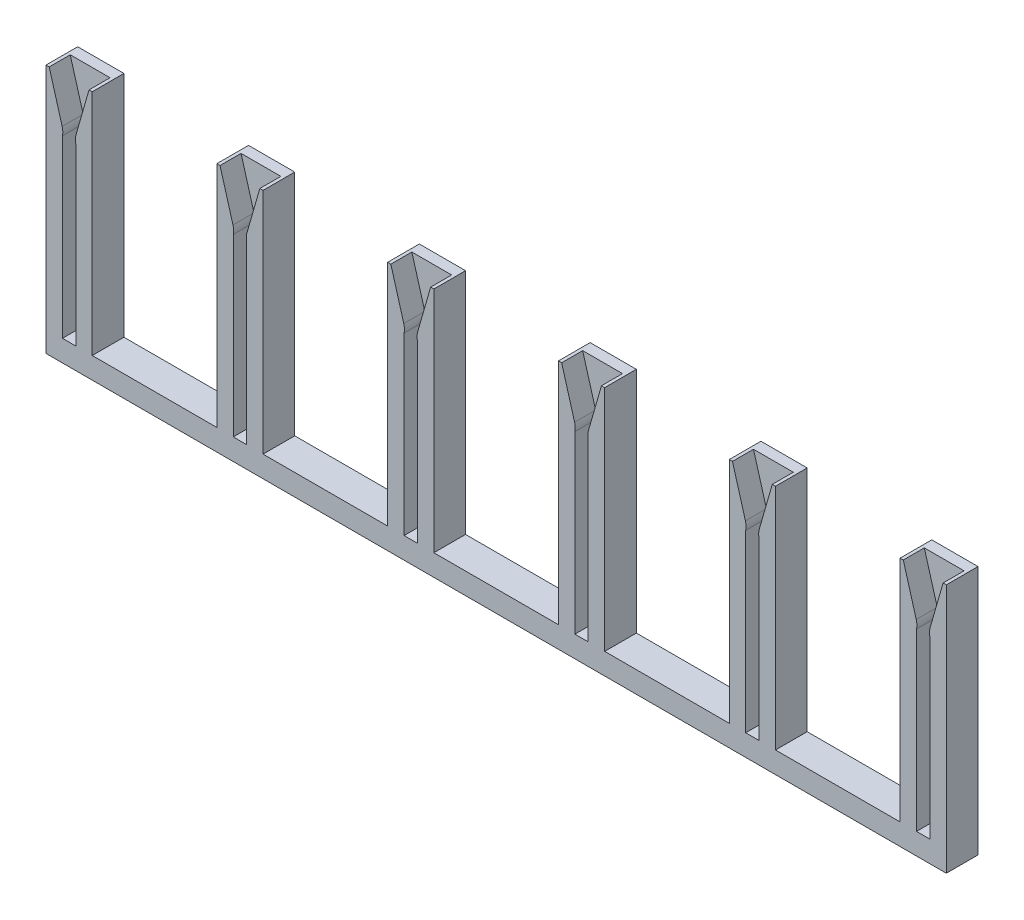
ISO-10303-21;
HEADER;
FILE_DESCRIPTION(('STEP AP214'),'2;1');
FILE_NAME('part.step','',(''),(''),'','','');
FILE_SCHEMA(('AUTOMOTIVE_DESIGN { 1 0 10303 214 1 1 1 1 }'));
ENDSEC;
DATA;
#1=APPLICATION_CONTEXT('core data for automotive mechanical design processes');
#2=APPLICATION_PROTOCOL_DEFINITION('international standard','automotive_design',2000,#1);
#3=PRODUCT_CONTEXT('',#1,'mechanical');
#4=PRODUCT('Part','Part','',(#3));
#5=PRODUCT_RELATED_PRODUCT_CATEGORY('part','',(#4));
#6=PRODUCT_DEFINITION_FORMATION('','',#4);
#7=PRODUCT_DEFINITION_CONTEXT('part definition',#1,'design');
#8=PRODUCT_DEFINITION('design','',#6,#7);
#9=PRODUCT_DEFINITION_SHAPE('','',#8);
#10=(LENGTH_UNIT() NAMED_UNIT(*) SI_UNIT(.MILLI.,.METRE.));
#11=(NAMED_UNIT(*) PLANE_ANGLE_UNIT() SI_UNIT($,.RADIAN.));
#12=(NAMED_UNIT(*) SI_UNIT($,.STERADIAN.) SOLID_ANGLE_UNIT());
#13=UNCERTAINTY_MEASURE_WITH_UNIT(LENGTH_MEASURE(1.E-05),#10,'distance_accuracy_value','');
#14=(GEOMETRIC_REPRESENTATION_CONTEXT(3) GLOBAL_UNCERTAINTY_ASSIGNED_CONTEXT((#13)) GLOBAL_UNIT_ASSIGNED_CONTEXT((#10,
#11,#12)) REPRESENTATION_CONTEXT('',''));
#15=CARTESIAN_POINT('',(0.,0.,0.));
#16=DIRECTION('',(0.,0.,1.));
#17=DIRECTION('',(1.,0.,0.));
#18=AXIS2_PLACEMENT_3D('',#15,#16,#17);
#19=CARTESIAN_POINT('',(2.75,0.,-2.500122));
#20=DIRECTION('',(-1.,0.,0.));
#21=DIRECTION('',(0.,0.,1.));
#22=AXIS2_PLACEMENT_3D('',#19,#20,#21);
#23=PLANE('',#22);
#24=DIRECTION('',(0.,-1.,0.));
#25=VECTOR('',#24,1.);
#26=CARTESIAN_POINT('',(2.75,0.,0.));
#27=LINE('',#26,#25);
#28=CARTESIAN_POINT('',(2.74999999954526,27.1756449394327,0.));
#29=VERTEX_POINT('',#28);
#30=CARTESIAN_POINT('',(2.75,-2.54,0.));
#31=VERTEX_POINT('',#30);
#32=EDGE_CURVE('E101',#29,#31,#27,.T.);
#33=ORIENTED_EDGE('',*,*,#32,.T.);
#34=DIRECTION('',(0.,0.,1.));
#35=VECTOR('',#34,1.);
#36=CARTESIAN_POINT('',(2.75,-2.54,-2.500122));
#37=LINE('',#36,#35);
#38=CARTESIAN_POINT('',(2.75,-2.54,-3.770122));
#39=VERTEX_POINT('',#38);
#40=EDGE_CURVE('E11',#39,#31,#37,.T.);
#41=ORIENTED_EDGE('',*,*,#40,.F.);
#42=DIRECTION('',(1.53031514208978E-11,-1.,0.));
#43=VECTOR('',#42,1.);
#44=CARTESIAN_POINT('',(2.74999999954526,27.1756449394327,-3.770122));
#45=LINE('',#44,#43);
#46=CARTESIAN_POINT('',(2.74999999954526,27.1756449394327,-3.770122));
#47=VERTEX_POINT('',#46);
#48=EDGE_CURVE('E853',#47,#39,#45,.T.);
#49=ORIENTED_EDGE('',*,*,#48,.F.);
#50=DIRECTION('',(0.,0.,1.));
#51=VECTOR('',#50,1.);
#52=CARTESIAN_POINT('',(2.74999999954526,27.1756449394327,-2.500122));
#53=LINE('',#52,#51);
#54=EDGE_CURVE('E166',#47,#29,#53,.T.);
#55=ORIENTED_EDGE('',*,*,#54,.T.);
#56=EDGE_LOOP('',(#33,#41,#49,#55));
#57=FACE_BOUND('',#56,.T.);
#58=ADVANCED_FACE('F32',(#57),#23,.F.);
#59=CARTESIAN_POINT('',(2.75,-2.54,-2.500122));
#60=DIRECTION('',(0.,1.,0.));
#61=DIRECTION('',(0.,0.,1.));
#62=AXIS2_PLACEMENT_3D('',#59,#60,#61);
#63=PLANE('',#62);
#64=DIRECTION('',(-1.,0.,0.));
#65=VECTOR('',#64,1.);
#66=CARTESIAN_POINT('',(2.75,-2.54,0.));
#67=LINE('',#66,#65);
#68=CARTESIAN_POINT('',(-104.35,-2.53999999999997,0.));
#69=VERTEX_POINT('',#68);
#70=EDGE_CURVE('E182',#31,#69,#67,.T.);
#71=ORIENTED_EDGE('',*,*,#70,.T.);
#72=DIRECTION('',(0.,0.,-1.));
#73=VECTOR('',#72,1.);
#74=CARTESIAN_POINT('',(-104.35,-2.53999999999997,5.00000000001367E-05));
#75=LINE('',#74,#73);
#76=CARTESIAN_POINT('',(-104.35,-2.53999999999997,-3.770122));
#77=VERTEX_POINT('',#76);
#78=EDGE_CURVE('E608',#69,#77,#75,.T.);
#79=ORIENTED_EDGE('',*,*,#78,.T.);
#80=DIRECTION('',(-1.,0.,0.));
#81=VECTOR('',#80,1.);
#82=CARTESIAN_POINT('',(2.75,-2.54,-3.770122));
#83=LINE('',#82,#81);
#84=EDGE_CURVE('E856',#39,#77,#83,.T.);
#85=ORIENTED_EDGE('',*,*,#84,.F.);
#86=ORIENTED_EDGE('',*,*,#40,.T.);
#87=EDGE_LOOP('',(#71,#79,#85,#86));
#88=FACE_BOUND('',#87,.T.);
#89=ADVANCED_FACE('F892',(#88),#63,.F.);
#90=CARTESIAN_POINT('',(-17.57,0.,-2.500122));
#91=DIRECTION('',(0.,-1.,0.));
#92=DIRECTION('',(1.,0.,0.));
#93=AXIS2_PLACEMENT_3D('',#90,#91,#92);
#94=PLANE('',#93);
#95=DIRECTION('',(1.,0.,0.));
#96=VECTOR('',#95,1.);
#97=CARTESIAN_POINT('',(-17.57,0.,0.));
#98=LINE('',#97,#96);
#99=CARTESIAN_POINT('',(-17.57,0.,0.));
#100=VERTEX_POINT('',#99);
#101=CARTESIAN_POINT('',(-2.75,0.,0.));
#102=VERTEX_POINT('',#101);
#103=EDGE_CURVE('E180',#100,#102,#98,.T.);
#104=ORIENTED_EDGE('',*,*,#103,.T.);
#105=DIRECTION('',(0.,0.,1.));
#106=VECTOR('',#105,1.);
#107=CARTESIAN_POINT('',(-2.75,0.,-2.500122));
#108=LINE('',#107,#106);
#109=CARTESIAN_POINT('',(-2.75,0.,-3.770122));
#110=VERTEX_POINT('',#109);
#111=EDGE_CURVE('E223',#110,#102,#108,.T.);
#112=ORIENTED_EDGE('',*,*,#111,.F.);
#113=DIRECTION('',(1.,0.,0.));
#114=VECTOR('',#113,1.);
#115=CARTESIAN_POINT('',(-17.57,0.,-3.770122));
#116=LINE('',#115,#114);
#117=CARTESIAN_POINT('',(-17.57,0.,-3.770122));
#118=VERTEX_POINT('',#117);
#119=EDGE_CURVE('E858',#118,#110,#116,.T.);
#120=ORIENTED_EDGE('',*,*,#119,.F.);
#121=DIRECTION('',(0.,0.,1.));
#122=VECTOR('',#121,1.);
#123=CARTESIAN_POINT('',(-17.57,0.,-2.500122));
#124=LINE('',#123,#122);
#125=EDGE_CURVE('E35',#118,#100,#124,.T.);
#126=ORIENTED_EDGE('',*,*,#125,.T.);
#127=EDGE_LOOP('',(#104,#112,#120,#126));
#128=FACE_BOUND('',#127,.T.);
#129=ADVANCED_FACE('F888',(#128),#94,.F.);
#130=CARTESIAN_POINT('',(-2.75,0.,-2.500122));
#131=DIRECTION('',(1.,-1.67334764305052E-11,0.));
#132=DIRECTION('',(1.67334764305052E-11,1.,0.));
#133=AXIS2_PLACEMENT_3D('',#130,#131,#132);
#134=PLANE('',#133);
#135=DIRECTION('',(1.67334764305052E-11,1.,0.));
#136=VECTOR('',#135,1.);
#137=CARTESIAN_POINT('',(-2.75,0.,0.));
#138=LINE('',#137,#136);
#139=CARTESIAN_POINT('',(-2.74999999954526,27.1756449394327,0.));
#140=VERTEX_POINT('',#139);
#141=EDGE_CURVE('E181',#102,#140,#138,.T.);
#142=ORIENTED_EDGE('',*,*,#141,.T.);
#143=DIRECTION('',(0.,0.,1.));
#144=VECTOR('',#143,1.);
#145=CARTESIAN_POINT('',(-2.74999999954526,27.1756449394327,-2.500122));
#146=LINE('',#145,#144);
#147=CARTESIAN_POINT('',(-2.74999999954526,27.1756449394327,-3.770122));
#148=VERTEX_POINT('',#147);
#149=EDGE_CURVE('E170',#148,#140,#146,.T.);
#150=ORIENTED_EDGE('',*,*,#149,.F.);
#151=DIRECTION('',(1.67334764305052E-11,1.,0.));
#152=VECTOR('',#151,1.);
#153=CARTESIAN_POINT('',(-2.75,0.,-3.770122));
#154=LINE('',#153,#152);
#155=EDGE_CURVE('E861',#110,#148,#154,.T.);
#156=ORIENTED_EDGE('',*,*,#155,.F.);
#157=ORIENTED_EDGE('',*,*,#111,.T.);
#158=EDGE_LOOP('',(#142,#150,#156,#157));
#159=FACE_BOUND('',#158,.T.);
#160=ADVANCED_FACE('F881',(#159),#134,.F.);
#161=CARTESIAN_POINT('',(-2.36899999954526,27.1756449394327,-2.500122));
#162=DIRECTION('',(-0.961021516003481,-0.276473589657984,0.));
#163=DIRECTION('',(0.276473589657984,-0.961021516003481,0.));
#164=AXIS2_PLACEMENT_3D('',#161,#162,#163);
#165=PLANE('',#164);
#166=DIRECTION('',(0.276473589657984,-0.961021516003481,0.));
#167=VECTOR('',#166,1.);
#168=CARTESIAN_POINT('',(-2.36899999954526,27.1756449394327,0.));
#169=LINE('',#168,#167);
#170=CARTESIAN_POINT('',(-2.36899999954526,27.1756449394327,0.));
#171=VERTEX_POINT('',#170);
#172=CARTESIAN_POINT('',(-0.827956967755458,21.8189831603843,0.));
#173=VERTEX_POINT('',#172);
#174=EDGE_CURVE('E197',#171,#173,#169,.T.);
#175=ORIENTED_EDGE('',*,*,#174,.T.);
#176=DIRECTION('',(0.,0.,1.));
#177=VECTOR('',#176,1.);
#178=CARTESIAN_POINT('',(-0.827956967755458,21.8189831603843,-2.500122));
#179=LINE('',#178,#177);
#180=CARTESIAN_POINT('',(-0.827956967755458,21.8189831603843,-2.500122));
#181=VERTEX_POINT('',#180);
#182=EDGE_CURVE('E171',#181,#173,#179,.T.);
#183=ORIENTED_EDGE('',*,*,#182,.F.);
#184=DIRECTION('',(0.276473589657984,-0.961021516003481,0.));
#185=VECTOR('',#184,1.);
#186=CARTESIAN_POINT('',(-2.36899999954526,27.1756449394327,-2.500122));
#187=LINE('',#186,#185);
#188=CARTESIAN_POINT('',(-2.36899999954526,27.1756449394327,-2.500122));
#189=VERTEX_POINT('',#188);
#190=EDGE_CURVE('E174',#189,#181,#187,.T.);
#191=ORIENTED_EDGE('',*,*,#190,.F.);
#192=DIRECTION('',(0.,0.,1.));
#193=VECTOR('',#192,1.);
#194=CARTESIAN_POINT('',(-2.36899999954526,27.1756449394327,-2.500122));
#195=LINE('',#194,#193);
#196=EDGE_CURVE('E109',#189,#171,#195,.T.);
#197=ORIENTED_EDGE('',*,*,#196,.T.);
#198=EDGE_LOOP('',(#175,#183,#191,#197));
#199=FACE_BOUND('',#198,.T.);
#200=ADVANCED_FACE('F879',(#199),#165,.F.);
#201=CARTESIAN_POINT('',(-2.75000000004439,21.2660359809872,-2.500122));
#202=DIRECTION('',(0.,0.,1.));
#203=DIRECTION('',(1.,0.,0.));
#204=AXIS2_PLACEMENT_3D('',#201,#202,#203);
#205=CYLINDRICAL_SURFACE('',#204,2.0000000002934);
#206=CARTESIAN_POINT('',(-2.75000000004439,21.2660359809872,0.));
#207=DIRECTION('',(0.,0.,-1.));
#208=DIRECTION('',(-1.,0.,0.));
#209=AXIS2_PLACEMENT_3D('',#206,#207,#208);
#210=CIRCLE('',#209,2.0000000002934);
#211=CARTESIAN_POINT('',(-0.79375000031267,20.8499999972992,0.));
#212=VERTEX_POINT('',#211);
#213=EDGE_CURVE('E199',#173,#212,#210,.T.);
#214=ORIENTED_EDGE('',*,*,#213,.T.);
#215=DIRECTION('',(0.,0.,1.));
#216=VECTOR('',#215,1.);
#217=CARTESIAN_POINT('',(-0.79375000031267,20.8499999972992,-2.500122));
#218=LINE('',#217,#216);
#219=CARTESIAN_POINT('',(-0.79375000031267,20.8499999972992,-2.500122));
#220=VERTEX_POINT('',#219);
#221=EDGE_CURVE('E216',#220,#212,#218,.T.);
#222=ORIENTED_EDGE('',*,*,#221,.F.);
#223=CARTESIAN_POINT('',(-2.75000000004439,21.2660359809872,-2.500122));
#224=DIRECTION('',(0.,0.,-1.));
#225=DIRECTION('',(-1.,0.,0.));
#226=AXIS2_PLACEMENT_3D('',#223,#224,#225);
#227=CIRCLE('',#226,2.0000000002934);
#228=EDGE_CURVE('E153',#181,#220,#227,.T.);
#229=ORIENTED_EDGE('',*,*,#228,.F.);
#230=ORIENTED_EDGE('',*,*,#182,.T.);
#231=EDGE_LOOP('',(#214,#222,#229,#230));
#232=FACE_BOUND('',#231,.T.);
#233=ADVANCED_FACE('F870',(#232),#205,.T.);
#234=CARTESIAN_POINT('',(-0.793750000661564,0.,-2.500122));
#235=DIRECTION('',(-1.,1.67335139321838E-11,0.));
#236=DIRECTION('',(-1.67335139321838E-11,-1.,0.));
#237=AXIS2_PLACEMENT_3D('',#234,#235,#236);
#238=PLANE('',#237);
#239=DIRECTION('',(-1.67335139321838E-11,-1.,0.));
#240=VECTOR('',#239,1.);
#241=CARTESIAN_POINT('',(-0.793750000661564,0.,0.));
#242=LINE('',#241,#240);
#243=CARTESIAN_POINT('',(-0.793750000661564,0.,0.));
#244=VERTEX_POINT('',#243);
#245=EDGE_CURVE('E201',#212,#244,#242,.T.);
#246=ORIENTED_EDGE('',*,*,#245,.T.);
#247=DIRECTION('',(0.,0.,1.));
#248=VECTOR('',#247,1.);
#249=CARTESIAN_POINT('',(-0.793750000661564,0.,-2.500122));
#250=LINE('',#249,#248);
#251=CARTESIAN_POINT('',(-0.793750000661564,0.,-2.500122));
#252=VERTEX_POINT('',#251);
#253=EDGE_CURVE('E136',#252,#244,#250,.T.);
#254=ORIENTED_EDGE('',*,*,#253,.F.);
#255=DIRECTION('',(-1.67335139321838E-11,-1.,0.));
#256=VECTOR('',#255,1.);
#257=CARTESIAN_POINT('',(-0.793750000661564,0.,-2.500122));
#258=LINE('',#257,#256);
#259=EDGE_CURVE('E151',#220,#252,#258,.T.);
#260=ORIENTED_EDGE('',*,*,#259,.F.);
#261=ORIENTED_EDGE('',*,*,#221,.T.);
#262=EDGE_LOOP('',(#246,#254,#260,#261));
#263=FACE_BOUND('',#262,.T.);
#264=ADVANCED_FACE('F874',(#263),#238,.F.);
#265=CARTESIAN_POINT('',(-0.793750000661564,0.,-2.500122));
#266=DIRECTION('',(0.,-1.,0.));
#267=DIRECTION('',(0.,0.,-1.));
#268=AXIS2_PLACEMENT_3D('',#265,#266,#267);
#269=PLANE('',#268);
#270=DIRECTION('',(1.,0.,0.));
#271=VECTOR('',#270,1.);
#272=CARTESIAN_POINT('',(-0.793750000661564,0.,0.));
#273=LINE('',#272,#271);
#274=CARTESIAN_POINT('',(0.793750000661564,0.,0.));
#275=VERTEX_POINT('',#274);
#276=EDGE_CURVE('E133',#244,#275,#273,.T.);
#277=ORIENTED_EDGE('',*,*,#276,.T.);
#278=DIRECTION('',(0.,0.,1.));
#279=VECTOR('',#278,1.);
#280=CARTESIAN_POINT('',(0.793750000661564,0.,-2.500122));
#281=LINE('',#280,#279);
#282=CARTESIAN_POINT('',(0.793750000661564,0.,-2.500122));
#283=VERTEX_POINT('',#282);
#284=EDGE_CURVE('E125',#283,#275,#281,.T.);
#285=ORIENTED_EDGE('',*,*,#284,.F.);
#286=DIRECTION('',(1.,0.,0.));
#287=VECTOR('',#286,1.);
#288=CARTESIAN_POINT('',(-0.793750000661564,0.,-2.500122));
#289=LINE('',#288,#287);
#290=EDGE_CURVE('E130',#252,#283,#289,.T.);
#291=ORIENTED_EDGE('',*,*,#290,.F.);
#292=ORIENTED_EDGE('',*,*,#253,.T.);
#293=EDGE_LOOP('',(#277,#285,#291,#292));
#294=FACE_BOUND('',#293,.T.);
#295=ADVANCED_FACE('F127',(#294),#269,.F.);
#296=CARTESIAN_POINT('',(0.793750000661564,0.,-2.500122));
#297=DIRECTION('',(1.,1.67335139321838E-11,0.));
#298=DIRECTION('',(-1.67335139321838E-11,1.,0.));
#299=AXIS2_PLACEMENT_3D('',#296,#297,#298);
#300=PLANE('',#299);
#301=DIRECTION('',(-1.67335139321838E-11,1.,0.));
#302=VECTOR('',#301,1.);
#303=CARTESIAN_POINT('',(0.793750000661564,0.,0.));
#304=LINE('',#303,#302);
#305=CARTESIAN_POINT('',(0.793750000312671,20.8499999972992,0.));
#306=VERTEX_POINT('',#305);
#307=EDGE_CURVE('E204',#275,#306,#304,.T.);
#308=ORIENTED_EDGE('',*,*,#307,.T.);
#309=DIRECTION('',(0.,0.,1.));
#310=VECTOR('',#309,1.);
#311=CARTESIAN_POINT('',(0.793750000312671,20.8499999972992,-2.500122));
#312=LINE('',#311,#310);
#313=CARTESIAN_POINT('',(0.793750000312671,20.8499999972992,-2.500122));
#314=VERTEX_POINT('',#313);
#315=EDGE_CURVE('E137',#314,#306,#312,.T.);
#316=ORIENTED_EDGE('',*,*,#315,.F.);
#317=DIRECTION('',(-1.67335139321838E-11,1.,0.));
#318=VECTOR('',#317,1.);
#319=CARTESIAN_POINT('',(0.793750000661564,0.,-2.500122));
#320=LINE('',#319,#318);
#321=EDGE_CURVE('E140',#283,#314,#320,.T.);
#322=ORIENTED_EDGE('',*,*,#321,.F.);
#323=ORIENTED_EDGE('',*,*,#284,.T.);
#324=EDGE_LOOP('',(#308,#316,#322,#323));
#325=FACE_BOUND('',#324,.T.);
#326=ADVANCED_FACE('F141',(#325),#300,.F.);
#327=CARTESIAN_POINT('',(2.75000000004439,21.2660359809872,-2.500122));
#328=DIRECTION('',(0.,0.,1.));
#329=DIRECTION('',(1.,0.,0.));
#330=AXIS2_PLACEMENT_3D('',#327,#328,#329);
#331=CYLINDRICAL_SURFACE('',#330,2.0000000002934);
#332=CARTESIAN_POINT('',(2.75000000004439,21.2660359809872,0.));
#333=DIRECTION('',(0.,0.,-1.));
#334=DIRECTION('',(1.,0.,0.));
#335=AXIS2_PLACEMENT_3D('',#332,#333,#334);
#336=CIRCLE('',#335,2.0000000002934);
#337=CARTESIAN_POINT('',(0.827956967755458,21.8189831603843,0.));
#338=VERTEX_POINT('',#337);
#339=EDGE_CURVE('E206',#306,#338,#336,.T.);
#340=ORIENTED_EDGE('',*,*,#339,.T.);
#341=DIRECTION('',(0.,0.,1.));
#342=VECTOR('',#341,1.);
#343=CARTESIAN_POINT('',(0.827956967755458,21.8189831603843,-2.500122));
#344=LINE('',#343,#342);
#345=CARTESIAN_POINT('',(0.827956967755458,21.8189831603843,-2.500122));
#346=VERTEX_POINT('',#345);
#347=EDGE_CURVE('E50',#346,#338,#344,.T.);
#348=ORIENTED_EDGE('',*,*,#347,.F.);
#349=CARTESIAN_POINT('',(2.75000000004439,21.2660359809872,-2.500122));
#350=DIRECTION('',(0.,0.,-1.));
#351=DIRECTION('',(1.,0.,0.));
#352=AXIS2_PLACEMENT_3D('',#349,#350,#351);
#353=CIRCLE('',#352,2.0000000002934);
#354=EDGE_CURVE('E145',#314,#346,#353,.T.);
#355=ORIENTED_EDGE('',*,*,#354,.F.);
#356=ORIENTED_EDGE('',*,*,#315,.T.);
#357=EDGE_LOOP('',(#340,#348,#355,#356));
#358=FACE_BOUND('',#357,.T.);
#359=ADVANCED_FACE('F231',(#358),#331,.T.);
#360=CARTESIAN_POINT('',(2.36899999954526,27.1756449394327,-2.500122));
#361=DIRECTION('',(0.961021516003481,-0.276473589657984,0.));
#362=DIRECTION('',(0.276473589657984,0.961021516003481,0.));
#363=AXIS2_PLACEMENT_3D('',#360,#361,#362);
#364=PLANE('',#363);
#365=DIRECTION('',(0.276473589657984,0.961021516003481,0.));
#366=VECTOR('',#365,1.);
#367=CARTESIAN_POINT('',(2.36899999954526,27.1756449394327,0.));
#368=LINE('',#367,#366);
#369=CARTESIAN_POINT('',(2.36899999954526,27.1756449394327,0.));
#370=VERTEX_POINT('',#369);
#371=EDGE_CURVE('E94',#338,#370,#368,.T.);
#372=ORIENTED_EDGE('',*,*,#371,.T.);
#373=DIRECTION('',(0.,0.,1.));
#374=VECTOR('',#373,1.);
#375=CARTESIAN_POINT('',(2.36899999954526,27.1756449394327,-2.500122));
#376=LINE('',#375,#374);
#377=CARTESIAN_POINT('',(2.36899999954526,27.1756449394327,-2.500122));
#378=VERTEX_POINT('',#377);
#379=EDGE_CURVE('E212',#378,#370,#376,.T.);
#380=ORIENTED_EDGE('',*,*,#379,.F.);
#381=DIRECTION('',(0.276473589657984,0.961021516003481,0.));
#382=VECTOR('',#381,1.);
#383=CARTESIAN_POINT('',(2.36899999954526,27.1756449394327,-2.500122));
#384=LINE('',#383,#382);
#385=EDGE_CURVE('E158',#346,#378,#384,.T.);
#386=ORIENTED_EDGE('',*,*,#385,.F.);
#387=ORIENTED_EDGE('',*,*,#347,.T.);
#388=EDGE_LOOP('',(#372,#380,#386,#387));
#389=FACE_BOUND('',#388,.T.);
#390=ADVANCED_FACE('F232',(#389),#364,.F.);
#391=CARTESIAN_POINT('',(2.74999999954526,27.1756449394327,-2.500122));
#392=DIRECTION('',(0.,-1.,0.));
#393=DIRECTION('',(1.,0.,0.));
#394=AXIS2_PLACEMENT_3D('',#391,#392,#393);
#395=PLANE('',#394);
#396=DIRECTION('',(1.,0.,0.));
#397=VECTOR('',#396,1.);
#398=CARTESIAN_POINT('',(2.74999999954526,27.1756449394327,0.));
#399=LINE('',#398,#397);
#400=EDGE_CURVE('E177',#370,#29,#399,.T.);
#401=ORIENTED_EDGE('',*,*,#400,.T.);
#402=ORIENTED_EDGE('',*,*,#54,.F.);
#403=DIRECTION('',(1.,0.,0.));
#404=VECTOR('',#403,1.);
#405=CARTESIAN_POINT('',(2.74999999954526,27.1756449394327,-3.770122));
#406=LINE('',#405,#404);
#407=EDGE_CURVE('E194',#148,#47,#406,.T.);
#408=ORIENTED_EDGE('',*,*,#407,.F.);
#409=ORIENTED_EDGE('',*,*,#149,.T.);
#410=DIRECTION('',(1.,0.,0.));
#411=VECTOR('',#410,1.);
#412=CARTESIAN_POINT('',(-2.74999999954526,27.1756449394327,0.));
#413=LINE('',#412,#411);
#414=EDGE_CURVE('E188',#140,#171,#413,.T.);
#415=ORIENTED_EDGE('',*,*,#414,.T.);
#416=ORIENTED_EDGE('',*,*,#196,.F.);
#417=DIRECTION('',(1.,0.,0.));
#418=VECTOR('',#417,1.);
#419=CARTESIAN_POINT('',(2.74999999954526,27.1756449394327,-2.500122));
#420=LINE('',#419,#418);
#421=EDGE_CURVE('E227',#189,#378,#420,.T.);
#422=ORIENTED_EDGE('',*,*,#421,.T.);
#423=ORIENTED_EDGE('',*,*,#379,.T.);
#424=EDGE_LOOP('',(#401,#402,#408,#409,#415,#416,#422,#423));
#425=FACE_BOUND('',#424,.T.);
#426=ADVANCED_FACE('F225',(#425),#395,.F.);
#427=CARTESIAN_POINT('',(2.75000000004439,21.2660359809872,0.));
#428=DIRECTION('',(0.,0.,1.));
#429=DIRECTION('',(1.,0.,0.));
#430=AXIS2_PLACEMENT_3D('',#427,#428,#429);
#431=PLANE('',#430);
#432=DIRECTION('',(1.67334764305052E-11,1.,0.));
#433=VECTOR('',#432,1.);
#434=CARTESIAN_POINT('',(-104.35,0.,0.));
#435=LINE('',#434,#433);
#436=CARTESIAN_POINT('',(-104.349999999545,27.1756449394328,0.));
#437=VERTEX_POINT('',#436);
#438=EDGE_CURVE('E600',#69,#437,#435,.T.);
#439=ORIENTED_EDGE('',*,*,#438,.F.);
#440=ORIENTED_EDGE('',*,*,#70,.F.);
#441=ORIENTED_EDGE('',*,*,#32,.F.);
#442=ORIENTED_EDGE('',*,*,#400,.F.);
#443=ORIENTED_EDGE('',*,*,#371,.F.);
#444=ORIENTED_EDGE('',*,*,#339,.F.);
#445=ORIENTED_EDGE('',*,*,#307,.F.);
#446=ORIENTED_EDGE('',*,*,#276,.F.);
#447=ORIENTED_EDGE('',*,*,#245,.F.);
#448=ORIENTED_EDGE('',*,*,#213,.F.);
#449=ORIENTED_EDGE('',*,*,#174,.F.);
#450=ORIENTED_EDGE('',*,*,#414,.F.);
#451=ORIENTED_EDGE('',*,*,#141,.F.);
#452=ORIENTED_EDGE('',*,*,#103,.F.);
#453=DIRECTION('',(0.,-1.,0.));
#454=VECTOR('',#453,1.);
#455=CARTESIAN_POINT('',(-17.57,0.,0.));
#456=LINE('',#455,#454);
#457=CARTESIAN_POINT('',(-17.5700000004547,27.1756449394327,0.));
#458=VERTEX_POINT('',#457);
#459=EDGE_CURVE('E845',#458,#100,#456,.T.);
#460=ORIENTED_EDGE('',*,*,#459,.F.);
#461=DIRECTION('',(1.,0.,0.));
#462=VECTOR('',#461,1.);
#463=CARTESIAN_POINT('',(-17.5700000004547,27.1756449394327,0.));
#464=LINE('',#463,#462);
#465=CARTESIAN_POINT('',(-17.9510000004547,27.1756449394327,0.));
#466=VERTEX_POINT('',#465);
#467=EDGE_CURVE('E821',#466,#458,#464,.T.);
#468=ORIENTED_EDGE('',*,*,#467,.F.);
#469=DIRECTION('',(0.276473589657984,0.961021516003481,0.));
#470=VECTOR('',#469,1.);
#471=CARTESIAN_POINT('',(-17.9510000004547,27.1756449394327,0.));
#472=LINE('',#471,#470);
#473=CARTESIAN_POINT('',(-19.4920430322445,21.8189831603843,0.));
#474=VERTEX_POINT('',#473);
#475=EDGE_CURVE('E965',#474,#466,#472,.T.);
#476=ORIENTED_EDGE('',*,*,#475,.F.);
#477=CARTESIAN_POINT('',(-17.5699999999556,21.2660359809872,0.));
#478=DIRECTION('',(0.,0.,-1.));
#479=DIRECTION('',(1.,0.,0.));
#480=AXIS2_PLACEMENT_3D('',#477,#478,#479);
#481=CIRCLE('',#480,2.0000000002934);
#482=CARTESIAN_POINT('',(-19.5262499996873,20.8499999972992,0.));
#483=VERTEX_POINT('',#482);
#484=EDGE_CURVE('E964',#483,#474,#481,.T.);
#485=ORIENTED_EDGE('',*,*,#484,.F.);
#486=DIRECTION('',(-1.67335139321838E-11,1.,0.));
#487=VECTOR('',#486,1.);
#488=CARTESIAN_POINT('',(-19.5262499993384,0.,0.));
#489=LINE('',#488,#487);
#490=CARTESIAN_POINT('',(-19.5262499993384,0.,0.));
#491=VERTEX_POINT('',#490);
#492=EDGE_CURVE('E962',#491,#483,#489,.T.);
#493=ORIENTED_EDGE('',*,*,#492,.F.);
#494=DIRECTION('',(1.,0.,0.));
#495=VECTOR('',#494,1.);
#496=CARTESIAN_POINT('',(-21.1137500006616,0.,0.));
#497=LINE('',#496,#495);
#498=CARTESIAN_POINT('',(-21.1137500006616,0.,0.));
#499=VERTEX_POINT('',#498);
#500=EDGE_CURVE('E960',#499,#491,#497,.T.);
#501=ORIENTED_EDGE('',*,*,#500,.F.);
#502=DIRECTION('',(-1.67335139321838E-11,-1.,0.));
#503=VECTOR('',#502,1.);
#504=CARTESIAN_POINT('',(-21.1137500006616,0.,0.));
#505=LINE('',#504,#503);
#506=CARTESIAN_POINT('',(-21.1137500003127,20.8499999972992,0.));
#507=VERTEX_POINT('',#506);
#508=EDGE_CURVE('E958',#507,#499,#505,.T.);
#509=ORIENTED_EDGE('',*,*,#508,.F.);
#510=CARTESIAN_POINT('',(-23.0700000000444,21.2660359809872,0.));
#511=DIRECTION('',(0.,0.,-1.));
#512=DIRECTION('',(-1.,0.,0.));
#513=AXIS2_PLACEMENT_3D('',#510,#511,#512);
#514=CIRCLE('',#513,2.0000000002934);
#515=CARTESIAN_POINT('',(-21.1479569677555,21.8189831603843,0.));
#516=VERTEX_POINT('',#515);
#517=EDGE_CURVE('E954',#516,#507,#514,.T.);
#518=ORIENTED_EDGE('',*,*,#517,.F.);
#519=DIRECTION('',(0.276473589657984,-0.961021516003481,0.));
#520=VECTOR('',#519,1.);
#521=CARTESIAN_POINT('',(-22.6889999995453,27.1756449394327,0.));
#522=LINE('',#521,#520);
#523=CARTESIAN_POINT('',(-22.6889999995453,27.1756449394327,0.));
#524=VERTEX_POINT('',#523);
#525=EDGE_CURVE('E952',#524,#516,#522,.T.);
#526=ORIENTED_EDGE('',*,*,#525,.F.);
#527=DIRECTION('',(1.,0.,0.));
#528=VECTOR('',#527,1.);
#529=CARTESIAN_POINT('',(-23.0699999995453,27.1756449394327,0.));
#530=LINE('',#529,#528);
#531=CARTESIAN_POINT('',(-23.0699999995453,27.1756449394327,0.));
#532=VERTEX_POINT('',#531);
#533=EDGE_CURVE('E949',#532,#524,#530,.T.);
#534=ORIENTED_EDGE('',*,*,#533,.F.);
#535=DIRECTION('',(1.67334764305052E-11,1.,0.));
#536=VECTOR('',#535,1.);
#537=CARTESIAN_POINT('',(-23.07,0.,0.));
#538=LINE('',#537,#536);
#539=CARTESIAN_POINT('',(-23.07,0.,0.));
#540=VERTEX_POINT('',#539);
#541=EDGE_CURVE('E842',#540,#532,#538,.T.);
#542=ORIENTED_EDGE('',*,*,#541,.F.);
#543=DIRECTION('',(1.,0.,0.));
#544=VECTOR('',#543,1.);
#545=CARTESIAN_POINT('',(-37.89,0.,0.));
#546=LINE('',#545,#544);
#547=CARTESIAN_POINT('',(-37.89,0.,0.));
#548=VERTEX_POINT('',#547);
#549=EDGE_CURVE('E849',#548,#540,#546,.T.);
#550=ORIENTED_EDGE('',*,*,#549,.F.);
#551=DIRECTION('',(0.,-1.,0.));
#552=VECTOR('',#551,1.);
#553=CARTESIAN_POINT('',(-37.89,0.,0.));
#554=LINE('',#553,#552);
#555=CARTESIAN_POINT('',(-37.8900000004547,27.1756449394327,0.));
#556=VERTEX_POINT('',#555);
#557=EDGE_CURVE('E810',#556,#548,#554,.T.);
#558=ORIENTED_EDGE('',*,*,#557,.F.);
#559=DIRECTION('',(1.,0.,0.));
#560=VECTOR('',#559,1.);
#561=CARTESIAN_POINT('',(-37.8900000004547,27.1756449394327,0.));
#562=LINE('',#561,#560);
#563=CARTESIAN_POINT('',(-38.2710000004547,27.1756449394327,0.));
#564=VERTEX_POINT('',#563);
#565=EDGE_CURVE('E786',#564,#556,#562,.T.);
#566=ORIENTED_EDGE('',*,*,#565,.F.);
#567=DIRECTION('',(0.276473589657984,0.961021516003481,0.));
#568=VECTOR('',#567,1.);
#569=CARTESIAN_POINT('',(-38.2710000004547,27.1756449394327,0.));
#570=LINE('',#569,#568);
#571=CARTESIAN_POINT('',(-39.8120430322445,21.8189831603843,0.));
#572=VERTEX_POINT('',#571);
#573=EDGE_CURVE('E1010',#572,#564,#570,.T.);
#574=ORIENTED_EDGE('',*,*,#573,.F.);
#575=CARTESIAN_POINT('',(-37.8899999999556,21.2660359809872,0.));
#576=DIRECTION('',(0.,0.,-1.));
#577=DIRECTION('',(1.,0.,0.));
#578=AXIS2_PLACEMENT_3D('',#575,#576,#577);
#579=CIRCLE('',#578,2.0000000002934);
#580=CARTESIAN_POINT('',(-39.8462499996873,20.8499999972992,0.));
#581=VERTEX_POINT('',#580);
#582=EDGE_CURVE('E1065',#581,#572,#579,.T.);
#583=ORIENTED_EDGE('',*,*,#582,.F.);
#584=DIRECTION('',(-1.67335139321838E-11,1.,0.));
#585=VECTOR('',#584,1.);
#586=CARTESIAN_POINT('',(-39.8462499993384,0.,0.));
#587=LINE('',#586,#585);
#588=CARTESIAN_POINT('',(-39.8462499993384,0.,0.));
#589=VERTEX_POINT('',#588);
#590=EDGE_CURVE('E1063',#589,#581,#587,.T.);
#591=ORIENTED_EDGE('',*,*,#590,.F.);
#592=DIRECTION('',(1.,0.,0.));
#593=VECTOR('',#592,1.);
#594=CARTESIAN_POINT('',(-41.4337500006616,0.,0.));
#595=LINE('',#594,#593);
#596=CARTESIAN_POINT('',(-41.4337500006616,0.,0.));
#597=VERTEX_POINT('',#596);
#598=EDGE_CURVE('E1061',#597,#589,#595,.T.);
#599=ORIENTED_EDGE('',*,*,#598,.F.);
#600=DIRECTION('',(-1.67335139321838E-11,-1.,0.));
#601=VECTOR('',#600,1.);
#602=CARTESIAN_POINT('',(-41.4337500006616,0.,0.));
#603=LINE('',#602,#601);
#604=CARTESIAN_POINT('',(-41.4337500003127,20.8499999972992,0.));
#605=VERTEX_POINT('',#604);
#606=EDGE_CURVE('E1059',#605,#597,#603,.T.);
#607=ORIENTED_EDGE('',*,*,#606,.F.);
#608=CARTESIAN_POINT('',(-43.3900000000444,21.2660359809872,0.));
#609=DIRECTION('',(0.,0.,-1.));
#610=DIRECTION('',(-1.,0.,0.));
#611=AXIS2_PLACEMENT_3D('',#608,#609,#610);
#612=CIRCLE('',#611,2.0000000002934);
#613=CARTESIAN_POINT('',(-41.4679569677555,21.8189831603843,0.));
#614=VERTEX_POINT('',#613);
#615=EDGE_CURVE('E1055',#614,#605,#612,.T.);
#616=ORIENTED_EDGE('',*,*,#615,.F.);
#617=DIRECTION('',(0.276473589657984,-0.961021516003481,0.));
#618=VECTOR('',#617,1.);
#619=CARTESIAN_POINT('',(-43.0089999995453,27.1756449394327,0.));
#620=LINE('',#619,#618);
#621=CARTESIAN_POINT('',(-43.0089999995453,27.1756449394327,0.));
#622=VERTEX_POINT('',#621);
#623=EDGE_CURVE('E1053',#622,#614,#620,.T.);
#624=ORIENTED_EDGE('',*,*,#623,.F.);
#625=DIRECTION('',(1.,0.,0.));
#626=VECTOR('',#625,1.);
#627=CARTESIAN_POINT('',(-43.3899999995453,27.1756449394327,0.));
#628=LINE('',#627,#626);
#629=CARTESIAN_POINT('',(-43.3899999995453,27.1756449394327,0.));
#630=VERTEX_POINT('',#629);
#631=EDGE_CURVE('E1050',#630,#622,#628,.T.);
#632=ORIENTED_EDGE('',*,*,#631,.F.);
#633=DIRECTION('',(1.67334764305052E-11,1.,0.));
#634=VECTOR('',#633,1.);
#635=CARTESIAN_POINT('',(-43.39,0.,0.));
#636=LINE('',#635,#634);
#637=CARTESIAN_POINT('',(-43.39,0.,0.));
#638=VERTEX_POINT('',#637);
#639=EDGE_CURVE('E807',#638,#630,#636,.T.);
#640=ORIENTED_EDGE('',*,*,#639,.F.);
#641=DIRECTION('',(1.,0.,0.));
#642=VECTOR('',#641,1.);
#643=CARTESIAN_POINT('',(-58.21,0.,0.));
#644=LINE('',#643,#642);
#645=CARTESIAN_POINT('',(-58.21,0.,0.));
#646=VERTEX_POINT('',#645);
#647=EDGE_CURVE('E813',#646,#638,#644,.T.);
#648=ORIENTED_EDGE('',*,*,#647,.F.);
#649=DIRECTION('',(0.,-1.,0.));
#650=VECTOR('',#649,1.);
#651=CARTESIAN_POINT('',(-58.21,0.,0.));
#652=LINE('',#651,#650);
#653=CARTESIAN_POINT('',(-58.2100000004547,27.1756449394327,0.));
#654=VERTEX_POINT('',#653);
#655=EDGE_CURVE('E775',#654,#646,#652,.T.);
#656=ORIENTED_EDGE('',*,*,#655,.F.);
#657=DIRECTION('',(1.,0.,0.));
#658=VECTOR('',#657,1.);
#659=CARTESIAN_POINT('',(-58.2100000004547,27.1756449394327,0.));
#660=LINE('',#659,#658);
#661=CARTESIAN_POINT('',(-58.5910000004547,27.1756449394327,0.));
#662=VERTEX_POINT('',#661);
#663=EDGE_CURVE('E751',#662,#654,#660,.T.);
#664=ORIENTED_EDGE('',*,*,#663,.F.);
#665=DIRECTION('',(0.276473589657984,0.961021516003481,0.));
#666=VECTOR('',#665,1.);
#667=CARTESIAN_POINT('',(-58.5910000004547,27.1756449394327,0.));
#668=LINE('',#667,#666);
#669=CARTESIAN_POINT('',(-60.1320430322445,21.8189831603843,0.));
#670=VERTEX_POINT('',#669);
#671=EDGE_CURVE('E1106',#670,#662,#668,.T.);
#672=ORIENTED_EDGE('',*,*,#671,.F.);
#673=CARTESIAN_POINT('',(-58.2099999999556,21.2660359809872,0.));
#674=DIRECTION('',(0.,0.,-1.));
#675=DIRECTION('',(1.,0.,0.));
#676=AXIS2_PLACEMENT_3D('',#673,#674,#675);
#677=CIRCLE('',#676,2.0000000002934);
#678=CARTESIAN_POINT('',(-60.1662499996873,20.8499999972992,0.));
#679=VERTEX_POINT('',#678);
#680=EDGE_CURVE('E1161',#679,#670,#677,.T.);
#681=ORIENTED_EDGE('',*,*,#680,.F.);
#682=DIRECTION('',(-1.67335139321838E-11,1.,0.));
#683=VECTOR('',#682,1.);
#684=CARTESIAN_POINT('',(-60.1662499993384,0.,0.));
#685=LINE('',#684,#683);
#686=CARTESIAN_POINT('',(-60.1662499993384,0.,0.));
#687=VERTEX_POINT('',#686);
#688=EDGE_CURVE('E1159',#687,#679,#685,.T.);
#689=ORIENTED_EDGE('',*,*,#688,.F.);
#690=DIRECTION('',(1.,0.,0.));
#691=VECTOR('',#690,1.);
#692=CARTESIAN_POINT('',(-61.7537500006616,0.,0.));
#693=LINE('',#692,#691);
#694=CARTESIAN_POINT('',(-61.7537500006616,0.,0.));
#695=VERTEX_POINT('',#694);
#696=EDGE_CURVE('E1157',#695,#687,#693,.T.);
#697=ORIENTED_EDGE('',*,*,#696,.F.);
#698=DIRECTION('',(-1.67335139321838E-11,-1.,0.));
#699=VECTOR('',#698,1.);
#700=CARTESIAN_POINT('',(-61.7537500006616,0.,0.));
#701=LINE('',#700,#699);
#702=CARTESIAN_POINT('',(-61.7537500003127,20.8499999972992,0.));
#703=VERTEX_POINT('',#702);
#704=EDGE_CURVE('E1155',#703,#695,#701,.T.);
#705=ORIENTED_EDGE('',*,*,#704,.F.);
#706=CARTESIAN_POINT('',(-63.7100000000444,21.2660359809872,0.));
#707=DIRECTION('',(0.,0.,-1.));
#708=DIRECTION('',(-1.,0.,0.));
#709=AXIS2_PLACEMENT_3D('',#706,#707,#708);
#710=CIRCLE('',#709,2.0000000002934);
#711=CARTESIAN_POINT('',(-61.7879569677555,21.8189831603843,0.));
#712=VERTEX_POINT('',#711);
#713=EDGE_CURVE('E1151',#712,#703,#710,.T.);
#714=ORIENTED_EDGE('',*,*,#713,.F.);
#715=DIRECTION('',(0.276473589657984,-0.961021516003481,0.));
#716=VECTOR('',#715,1.);
#717=CARTESIAN_POINT('',(-63.3289999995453,27.1756449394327,0.));
#718=LINE('',#717,#716);
#719=CARTESIAN_POINT('',(-63.3289999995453,27.1756449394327,0.));
#720=VERTEX_POINT('',#719);
#721=EDGE_CURVE('E1149',#720,#712,#718,.T.);
#722=ORIENTED_EDGE('',*,*,#721,.F.);
#723=DIRECTION('',(1.,0.,0.));
#724=VECTOR('',#723,1.);
#725=CARTESIAN_POINT('',(-63.7099999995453,27.1756449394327,0.));
#726=LINE('',#725,#724);
#727=CARTESIAN_POINT('',(-63.7099999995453,27.1756449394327,0.));
#728=VERTEX_POINT('',#727);
#729=EDGE_CURVE('E1146',#728,#720,#726,.T.);
#730=ORIENTED_EDGE('',*,*,#729,.F.);
#731=DIRECTION('',(1.67334764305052E-11,1.,0.));
#732=VECTOR('',#731,1.);
#733=CARTESIAN_POINT('',(-63.71,0.,0.));
#734=LINE('',#733,#732);
#735=CARTESIAN_POINT('',(-63.71,0.,0.));
#736=VERTEX_POINT('',#735);
#737=EDGE_CURVE('E772',#736,#728,#734,.T.);
#738=ORIENTED_EDGE('',*,*,#737,.F.);
#739=DIRECTION('',(1.,0.,0.));
#740=VECTOR('',#739,1.);
#741=CARTESIAN_POINT('',(-78.53,0.,0.));
#742=LINE('',#741,#740);
#743=CARTESIAN_POINT('',(-78.53,0.,0.));
#744=VERTEX_POINT('',#743);
#745=EDGE_CURVE('E778',#744,#736,#742,.T.);
#746=ORIENTED_EDGE('',*,*,#745,.F.);
#747=DIRECTION('',(0.,-1.,0.));
#748=VECTOR('',#747,1.);
#749=CARTESIAN_POINT('',(-78.53,0.,0.));
#750=LINE('',#749,#748);
#751=CARTESIAN_POINT('',(-78.5300000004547,27.1756449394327,0.));
#752=VERTEX_POINT('',#751);
#753=EDGE_CURVE('E741',#752,#744,#750,.T.);
#754=ORIENTED_EDGE('',*,*,#753,.F.);
#755=DIRECTION('',(1.,0.,0.));
#756=VECTOR('',#755,1.);
#757=CARTESIAN_POINT('',(-78.5300000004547,27.1756449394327,0.));
#758=LINE('',#757,#756);
#759=CARTESIAN_POINT('',(-78.9110000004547,27.1756449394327,0.));
#760=VERTEX_POINT('',#759);
#761=EDGE_CURVE('E717',#760,#752,#758,.T.);
#762=ORIENTED_EDGE('',*,*,#761,.F.);
#763=DIRECTION('',(0.276473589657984,0.961021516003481,0.));
#764=VECTOR('',#763,1.);
#765=CARTESIAN_POINT('',(-78.9110000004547,27.1756449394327,0.));
#766=LINE('',#765,#764);
#767=CARTESIAN_POINT('',(-80.4520430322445,21.8189831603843,0.));
#768=VERTEX_POINT('',#767);
#769=EDGE_CURVE('E1202',#768,#760,#766,.T.);
#770=ORIENTED_EDGE('',*,*,#769,.F.);
#771=CARTESIAN_POINT('',(-78.5299999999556,21.2660359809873,0.));
#772=DIRECTION('',(0.,0.,-1.));
#773=DIRECTION('',(1.,0.,0.));
#774=AXIS2_PLACEMENT_3D('',#771,#772,#773);
#775=CIRCLE('',#774,2.0000000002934);
#776=CARTESIAN_POINT('',(-80.4862499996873,20.8499999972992,0.));
#777=VERTEX_POINT('',#776);
#778=EDGE_CURVE('E1257',#777,#768,#775,.T.);
#779=ORIENTED_EDGE('',*,*,#778,.F.);
#780=DIRECTION('',(-1.67335139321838E-11,1.,0.));
#781=VECTOR('',#780,1.);
#782=CARTESIAN_POINT('',(-80.4862499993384,0.,0.));
#783=LINE('',#782,#781);
#784=CARTESIAN_POINT('',(-80.4862499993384,0.,0.));
#785=VERTEX_POINT('',#784);
#786=EDGE_CURVE('E1255',#785,#777,#783,.T.);
#787=ORIENTED_EDGE('',*,*,#786,.F.);
#788=DIRECTION('',(1.,0.,0.));
#789=VECTOR('',#788,1.);
#790=CARTESIAN_POINT('',(-82.0737500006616,0.,0.));
#791=LINE('',#790,#789);
#792=CARTESIAN_POINT('',(-82.0737500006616,0.,0.));
#793=VERTEX_POINT('',#792);
#794=EDGE_CURVE('E1253',#793,#785,#791,.T.);
#795=ORIENTED_EDGE('',*,*,#794,.F.);
#796=DIRECTION('',(-1.67335139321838E-11,-1.,0.));
#797=VECTOR('',#796,1.);
#798=CARTESIAN_POINT('',(-82.0737500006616,0.,0.));
#799=LINE('',#798,#797);
#800=CARTESIAN_POINT('',(-82.0737500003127,20.8499999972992,0.));
#801=VERTEX_POINT('',#800);
#802=EDGE_CURVE('E1251',#801,#793,#799,.T.);
#803=ORIENTED_EDGE('',*,*,#802,.F.);
#804=CARTESIAN_POINT('',(-84.0300000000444,21.2660359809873,0.));
#805=DIRECTION('',(0.,0.,-1.));
#806=DIRECTION('',(-1.,0.,0.));
#807=AXIS2_PLACEMENT_3D('',#804,#805,#806);
#808=CIRCLE('',#807,2.0000000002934);
#809=CARTESIAN_POINT('',(-82.1079569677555,21.8189831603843,0.));
#810=VERTEX_POINT('',#809);
#811=EDGE_CURVE('E1247',#810,#801,#808,.T.);
#812=ORIENTED_EDGE('',*,*,#811,.F.);
#813=DIRECTION('',(0.276473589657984,-0.961021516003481,0.));
#814=VECTOR('',#813,1.);
#815=CARTESIAN_POINT('',(-83.6489999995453,27.1756449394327,0.));
#816=LINE('',#815,#814);
#817=CARTESIAN_POINT('',(-83.6489999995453,27.1756449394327,0.));
#818=VERTEX_POINT('',#817);
#819=EDGE_CURVE('E1245',#818,#810,#816,.T.);
#820=ORIENTED_EDGE('',*,*,#819,.F.);
#821=DIRECTION('',(1.,0.,0.));
#822=VECTOR('',#821,1.);
#823=CARTESIAN_POINT('',(-84.0299999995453,27.1756449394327,0.));
#824=LINE('',#823,#822);
#825=CARTESIAN_POINT('',(-84.0299999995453,27.1756449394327,0.));
#826=VERTEX_POINT('',#825);
#827=EDGE_CURVE('E1242',#826,#818,#824,.T.);
#828=ORIENTED_EDGE('',*,*,#827,.F.);
#829=DIRECTION('',(1.67334764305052E-11,1.,0.));
#830=VECTOR('',#829,1.);
#831=CARTESIAN_POINT('',(-84.03,0.,0.));
#832=LINE('',#831,#830);
#833=CARTESIAN_POINT('',(-84.03,0.,0.));
#834=VERTEX_POINT('',#833);
#835=EDGE_CURVE('E738',#834,#826,#832,.T.);
#836=ORIENTED_EDGE('',*,*,#835,.F.);
#837=DIRECTION('',(1.,0.,0.));
#838=VECTOR('',#837,1.);
#839=CARTESIAN_POINT('',(-98.85,0.,0.));
#840=LINE('',#839,#838);
#841=CARTESIAN_POINT('',(-98.85,0.,0.));
#842=VERTEX_POINT('',#841);
#843=EDGE_CURVE('E744',#842,#834,#840,.T.);
#844=ORIENTED_EDGE('',*,*,#843,.F.);
#845=DIRECTION('',(0.,-1.,0.));
#846=VECTOR('',#845,1.);
#847=CARTESIAN_POINT('',(-98.85,0.,0.));
#848=LINE('',#847,#846);
#849=CARTESIAN_POINT('',(-98.8500000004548,27.1756449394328,0.));
#850=VERTEX_POINT('',#849);
#851=EDGE_CURVE('E606',#850,#842,#848,.T.);
#852=ORIENTED_EDGE('',*,*,#851,.F.);
#853=DIRECTION('',(1.,0.,0.));
#854=VECTOR('',#853,1.);
#855=CARTESIAN_POINT('',(-98.8500000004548,27.1756449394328,0.));
#856=LINE('',#855,#854);
#857=CARTESIAN_POINT('',(-99.2310000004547,27.1756449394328,0.));
#858=VERTEX_POINT('',#857);
#859=EDGE_CURVE('E687',#858,#850,#856,.T.);
#860=ORIENTED_EDGE('',*,*,#859,.F.);
#861=DIRECTION('',(0.276473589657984,0.961021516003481,0.));
#862=VECTOR('',#861,1.);
#863=CARTESIAN_POINT('',(-99.2310000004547,27.1756449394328,0.));
#864=LINE('',#863,#862);
#865=CARTESIAN_POINT('',(-100.772043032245,21.8189831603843,0.));
#866=VERTEX_POINT('',#865);
#867=EDGE_CURVE('E1297',#866,#858,#864,.T.);
#868=ORIENTED_EDGE('',*,*,#867,.F.);
#869=CARTESIAN_POINT('',(-98.8499999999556,21.2660359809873,0.));
#870=DIRECTION('',(0.,0.,-1.));
#871=DIRECTION('',(1.,0.,0.));
#872=AXIS2_PLACEMENT_3D('',#869,#870,#871);
#873=CIRCLE('',#872,2.0000000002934);
#874=CARTESIAN_POINT('',(-100.806249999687,20.8499999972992,0.));
#875=VERTEX_POINT('',#874);
#876=EDGE_CURVE('E2089',#875,#866,#873,.T.);
#877=ORIENTED_EDGE('',*,*,#876,.F.);
#878=DIRECTION('',(-1.67335139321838E-11,1.,0.));
#879=VECTOR('',#878,1.);
#880=CARTESIAN_POINT('',(-100.806249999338,0.,0.));
#881=LINE('',#880,#879);
#882=CARTESIAN_POINT('',(-100.806249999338,0.,0.));
#883=VERTEX_POINT('',#882);
#884=EDGE_CURVE('E2090',#883,#875,#881,.T.);
#885=ORIENTED_EDGE('',*,*,#884,.F.);
#886=DIRECTION('',(1.,0.,0.));
#887=VECTOR('',#886,1.);
#888=CARTESIAN_POINT('',(-102.393750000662,0.,0.));
#889=LINE('',#888,#887);
#890=CARTESIAN_POINT('',(-102.393750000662,0.,0.));
#891=VERTEX_POINT('',#890);
#892=EDGE_CURVE('E2085',#891,#883,#889,.T.);
#893=ORIENTED_EDGE('',*,*,#892,.F.);
#894=DIRECTION('',(-1.67335139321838E-11,-1.,0.));
#895=VECTOR('',#894,1.);
#896=CARTESIAN_POINT('',(-102.393750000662,0.,0.));
#897=LINE('',#896,#895);
#898=CARTESIAN_POINT('',(-102.393750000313,20.8499999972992,0.));
#899=VERTEX_POINT('',#898);
#900=EDGE_CURVE('E2082',#899,#891,#897,.T.);
#901=ORIENTED_EDGE('',*,*,#900,.F.);
#902=CARTESIAN_POINT('',(-104.350000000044,21.2660359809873,0.));
#903=DIRECTION('',(0.,0.,-1.));
#904=DIRECTION('',(-1.,0.,0.));
#905=AXIS2_PLACEMENT_3D('',#902,#903,#904);
#906=CIRCLE('',#905,2.0000000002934);
#907=CARTESIAN_POINT('',(-102.427956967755,21.8189831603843,0.));
#908=VERTEX_POINT('',#907);
#909=EDGE_CURVE('E2096',#908,#899,#906,.T.);
#910=ORIENTED_EDGE('',*,*,#909,.F.);
#911=DIRECTION('',(0.276473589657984,-0.961021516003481,0.));
#912=VECTOR('',#911,1.);
#913=CARTESIAN_POINT('',(-103.968999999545,27.1756449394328,0.));
#914=LINE('',#913,#912);
#915=CARTESIAN_POINT('',(-103.968999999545,27.1756449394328,0.));
#916=VERTEX_POINT('',#915);
#917=EDGE_CURVE('E2077',#916,#908,#914,.T.);
#918=ORIENTED_EDGE('',*,*,#917,.F.);
#919=DIRECTION('',(1.,0.,0.));
#920=VECTOR('',#919,1.);
#921=CARTESIAN_POINT('',(-104.349999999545,27.1756449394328,0.));
#922=LINE('',#921,#920);
#923=EDGE_CURVE('E603',#437,#916,#922,.T.);
#924=ORIENTED_EDGE('',*,*,#923,.F.);
#925=EDGE_LOOP('',(#439,#440,#441,#442,#443,#444,#445,#446,#447,#448,#449,#450,#451,#452,#460,
#468,#476,#485,#493,#501,#509,#518,#526,#534,#542,#550,#558,#566,#574,#583,#591,#599,#607,#616,
#624,#632,#640,#648,#656,#664,#672,#681,#689,#697,#705,#714,#722,#730,#738,#746,#754,#762,#770,
#779,#787,#795,#803,#812,#820,#828,#836,#844,#852,#860,#868,#877,#885,#893,#901,#910,#918,#924));
#926=FACE_BOUND('',#925,.T.);
#927=ADVANCED_FACE('F229',(#926),#431,.T.);
#928=CARTESIAN_POINT('',(0.,0.,-2.500122));
#929=DIRECTION('',(0.,0.,-1.));
#930=DIRECTION('',(-1.,0.,0.));
#931=AXIS2_PLACEMENT_3D('',#928,#929,#930);
#932=PLANE('',#931);
#933=ORIENTED_EDGE('',*,*,#421,.F.);
#934=ORIENTED_EDGE('',*,*,#190,.T.);
#935=ORIENTED_EDGE('',*,*,#228,.T.);
#936=ORIENTED_EDGE('',*,*,#259,.T.);
#937=ORIENTED_EDGE('',*,*,#290,.T.);
#938=ORIENTED_EDGE('',*,*,#321,.T.);
#939=ORIENTED_EDGE('',*,*,#354,.T.);
#940=ORIENTED_EDGE('',*,*,#385,.T.);
#941=EDGE_LOOP('',(#933,#934,#935,#936,#937,#938,#939,#940));
#942=FACE_BOUND('',#941,.T.);
#943=ADVANCED_FACE('F148',(#942),#932,.F.);
#944=CARTESIAN_POINT('',(0.,0.,-3.770122));
#945=DIRECTION('',(0.,0.,-1.));
#946=DIRECTION('',(-1.,0.,0.));
#947=AXIS2_PLACEMENT_3D('',#944,#945,#946);
#948=PLANE('',#947);
#949=ORIENTED_EDGE('',*,*,#84,.T.);
#950=DIRECTION('',(1.67334764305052E-11,1.,0.));
#951=VECTOR('',#950,1.);
#952=CARTESIAN_POINT('',(-104.35,0.,-3.770122));
#953=LINE('',#952,#951);
#954=CARTESIAN_POINT('',(-104.349999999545,27.1756449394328,-3.770122));
#955=VERTEX_POINT('',#954);
#956=EDGE_CURVE('E611',#77,#955,#953,.T.);
#957=ORIENTED_EDGE('',*,*,#956,.T.);
#958=DIRECTION('',(1.,0.,0.));
#959=VECTOR('',#958,1.);
#960=CARTESIAN_POINT('',(-98.8500000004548,27.1756449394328,-3.770122));
#961=LINE('',#960,#959);
#962=CARTESIAN_POINT('',(-98.8500000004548,27.1756449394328,-3.770122));
#963=VERTEX_POINT('',#962);
#964=EDGE_CURVE('E1326',#955,#963,#961,.T.);
#965=ORIENTED_EDGE('',*,*,#964,.T.);
#966=DIRECTION('',(1.53031514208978E-11,-1.,0.));
#967=VECTOR('',#966,1.);
#968=CARTESIAN_POINT('',(-98.8500000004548,27.1756449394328,-3.770122));
#969=LINE('',#968,#967);
#970=CARTESIAN_POINT('',(-98.8500000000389,0.,-3.770122));
#971=VERTEX_POINT('',#970);
#972=EDGE_CURVE('E617',#963,#971,#969,.T.);
#973=ORIENTED_EDGE('',*,*,#972,.T.);
#974=DIRECTION('',(1.,0.,0.));
#975=VECTOR('',#974,1.);
#976=CARTESIAN_POINT('',(-98.85,0.,-3.770122));
#977=LINE('',#976,#975);
#978=CARTESIAN_POINT('',(-84.03,0.,-3.770122));
#979=VERTEX_POINT('',#978);
#980=EDGE_CURVE('E635',#971,#979,#977,.T.);
#981=ORIENTED_EDGE('',*,*,#980,.T.);
#982=DIRECTION('',(1.67334764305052E-11,1.,0.));
#983=VECTOR('',#982,1.);
#984=CARTESIAN_POINT('',(-84.03,0.,-3.770122));
#985=LINE('',#984,#983);
#986=CARTESIAN_POINT('',(-84.0299999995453,27.1756449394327,-3.770122));
#987=VERTEX_POINT('',#986);
#988=EDGE_CURVE('E628',#979,#987,#985,.T.);
#989=ORIENTED_EDGE('',*,*,#988,.T.);
#990=DIRECTION('',(1.,0.,0.));
#991=VECTOR('',#990,1.);
#992=CARTESIAN_POINT('',(-78.5300000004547,27.1756449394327,-3.770122));
#993=LINE('',#992,#991);
#994=CARTESIAN_POINT('',(-78.5300000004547,27.1756449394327,-3.770122));
#995=VERTEX_POINT('',#994);
#996=EDGE_CURVE('E1328',#987,#995,#993,.T.);
#997=ORIENTED_EDGE('',*,*,#996,.T.);
#998=DIRECTION('',(1.53031514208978E-11,-1.,0.));
#999=VECTOR('',#998,1.);
#1000=CARTESIAN_POINT('',(-78.5300000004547,27.1756449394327,-3.770122));
#1001=LINE('',#1000,#999);
#1002=CARTESIAN_POINT('',(-78.5300000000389,0.,-3.770122));
#1003=VERTEX_POINT('',#1002);
#1004=EDGE_CURVE('E631',#995,#1003,#1001,.T.);
#1005=ORIENTED_EDGE('',*,*,#1004,.T.);
#1006=DIRECTION('',(1.,0.,0.));
#1007=VECTOR('',#1006,1.);
#1008=CARTESIAN_POINT('',(-78.53,0.,-3.770122));
#1009=LINE('',#1008,#1007);
#1010=CARTESIAN_POINT('',(-63.71,0.,-3.770122));
#1011=VERTEX_POINT('',#1010);
#1012=EDGE_CURVE('E648',#1003,#1011,#1009,.T.);
#1013=ORIENTED_EDGE('',*,*,#1012,.T.);
#1014=DIRECTION('',(1.67334764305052E-11,1.,0.));
#1015=VECTOR('',#1014,1.);
#1016=CARTESIAN_POINT('',(-63.71,0.,-3.770122));
#1017=LINE('',#1016,#1015);
#1018=CARTESIAN_POINT('',(-63.7099999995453,27.1756449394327,-3.770122));
#1019=VERTEX_POINT('',#1018);
#1020=EDGE_CURVE('E641',#1011,#1019,#1017,.T.);
#1021=ORIENTED_EDGE('',*,*,#1020,.T.);
#1022=DIRECTION('',(1.,0.,0.));
#1023=VECTOR('',#1022,1.);
#1024=CARTESIAN_POINT('',(-58.2100000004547,27.1756449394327,-3.770122));
#1025=LINE('',#1024,#1023);
#1026=CARTESIAN_POINT('',(-58.2100000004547,27.1756449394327,-3.770122));
#1027=VERTEX_POINT('',#1026);
#1028=EDGE_CURVE('E1334',#1019,#1027,#1025,.T.);
#1029=ORIENTED_EDGE('',*,*,#1028,.T.);
#1030=DIRECTION('',(1.53031514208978E-11,-1.,0.));
#1031=VECTOR('',#1030,1.);
#1032=CARTESIAN_POINT('',(-58.2100000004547,27.1756449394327,-3.770122));
#1033=LINE('',#1032,#1031);
#1034=CARTESIAN_POINT('',(-58.2100000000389,0.,-3.770122));
#1035=VERTEX_POINT('',#1034);
#1036=EDGE_CURVE('E644',#1027,#1035,#1033,.T.);
#1037=ORIENTED_EDGE('',*,*,#1036,.T.);
#1038=DIRECTION('',(1.,0.,0.));
#1039=VECTOR('',#1038,1.);
#1040=CARTESIAN_POINT('',(-58.21,0.,-3.770122));
#1041=LINE('',#1040,#1039);
#1042=CARTESIAN_POINT('',(-43.39,0.,-3.770122));
#1043=VERTEX_POINT('',#1042);
#1044=EDGE_CURVE('E661',#1035,#1043,#1041,.T.);
#1045=ORIENTED_EDGE('',*,*,#1044,.T.);
#1046=DIRECTION('',(1.67334764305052E-11,1.,0.));
#1047=VECTOR('',#1046,1.);
#1048=CARTESIAN_POINT('',(-43.39,0.,-3.770122));
#1049=LINE('',#1048,#1047);
#1050=CARTESIAN_POINT('',(-43.3899999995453,27.1756449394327,-3.770122));
#1051=VERTEX_POINT('',#1050);
#1052=EDGE_CURVE('E654',#1043,#1051,#1049,.T.);
#1053=ORIENTED_EDGE('',*,*,#1052,.T.);
#1054=DIRECTION('',(1.,0.,0.));
#1055=VECTOR('',#1054,1.);
#1056=CARTESIAN_POINT('',(-37.8900000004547,27.1756449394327,-3.770122));
#1057=LINE('',#1056,#1055);
#1058=CARTESIAN_POINT('',(-37.8900000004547,27.1756449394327,-3.770122));
#1059=VERTEX_POINT('',#1058);
#1060=EDGE_CURVE('E678',#1051,#1059,#1057,.T.);
#1061=ORIENTED_EDGE('',*,*,#1060,.T.);
#1062=DIRECTION('',(1.53031514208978E-11,-1.,0.));
#1063=VECTOR('',#1062,1.);
#1064=CARTESIAN_POINT('',(-37.8900000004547,27.1756449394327,-3.770122));
#1065=LINE('',#1064,#1063);
#1066=CARTESIAN_POINT('',(-37.8900000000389,0.,-3.770122));
#1067=VERTEX_POINT('',#1066);
#1068=EDGE_CURVE('E657',#1059,#1067,#1065,.T.);
#1069=ORIENTED_EDGE('',*,*,#1068,.T.);
#1070=DIRECTION('',(1.,0.,0.));
#1071=VECTOR('',#1070,1.);
#1072=CARTESIAN_POINT('',(-37.89,0.,-3.770122));
#1073=LINE('',#1072,#1071);
#1074=CARTESIAN_POINT('',(-23.07,0.,-3.770122));
#1075=VERTEX_POINT('',#1074);
#1076=EDGE_CURVE('E668',#1067,#1075,#1073,.T.);
#1077=ORIENTED_EDGE('',*,*,#1076,.T.);
#1078=DIRECTION('',(1.67334764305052E-11,1.,0.));
#1079=VECTOR('',#1078,1.);
#1080=CARTESIAN_POINT('',(-23.07,0.,-3.770122));
#1081=LINE('',#1080,#1079);
#1082=CARTESIAN_POINT('',(-23.0699999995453,27.1756449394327,-3.770122));
#1083=VERTEX_POINT('',#1082);
#1084=EDGE_CURVE('E670',#1075,#1083,#1081,.T.);
#1085=ORIENTED_EDGE('',*,*,#1084,.T.);
#1086=DIRECTION('',(1.,0.,0.));
#1087=VECTOR('',#1086,1.);
#1088=CARTESIAN_POINT('',(-17.5700000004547,27.1756449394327,-3.770122));
#1089=LINE('',#1088,#1087);
#1090=CARTESIAN_POINT('',(-17.5700000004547,27.1756449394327,-3.770122));
#1091=VERTEX_POINT('',#1090);
#1092=EDGE_CURVE('E673',#1083,#1091,#1089,.T.);
#1093=ORIENTED_EDGE('',*,*,#1092,.T.);
#1094=DIRECTION('',(1.53031514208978E-11,-1.,0.));
#1095=VECTOR('',#1094,1.);
#1096=CARTESIAN_POINT('',(-17.5700000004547,27.1756449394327,-3.770122));
#1097=LINE('',#1096,#1095);
#1098=EDGE_CURVE('E665',#1091,#118,#1097,.T.);
#1099=ORIENTED_EDGE('',*,*,#1098,.T.);
#1100=ORIENTED_EDGE('',*,*,#119,.T.);
#1101=ORIENTED_EDGE('',*,*,#155,.T.);
#1102=ORIENTED_EDGE('',*,*,#407,.T.);
#1103=ORIENTED_EDGE('',*,*,#48,.T.);
#1104=EDGE_LOOP('',(#949,#957,#965,#973,#981,#989,#997,#1005,#1013,#1021,#1029,#1037,#1045,
#1053,#1061,#1069,#1077,#1085,#1093,#1099,#1100,#1101,#1102,#1103));
#1105=FACE_BOUND('',#1104,.T.);
#1106=ADVANCED_FACE('F899',(#1105),#948,.T.);
#1107=CARTESIAN_POINT('',(-17.57,0.,-2.500122));
#1108=DIRECTION('',(-1.,0.,0.));
#1109=DIRECTION('',(0.,0.,1.));
#1110=AXIS2_PLACEMENT_3D('',#1107,#1108,#1109);
#1111=PLANE('',#1110);
#1112=ORIENTED_EDGE('',*,*,#459,.T.);
#1113=ORIENTED_EDGE('',*,*,#125,.F.);
#1114=ORIENTED_EDGE('',*,*,#1098,.F.);
#1115=DIRECTION('',(0.,0.,1.));
#1116=VECTOR('',#1115,1.);
#1117=CARTESIAN_POINT('',(-17.5700000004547,27.1756449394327,-2.500122));
#1118=LINE('',#1117,#1116);
#1119=EDGE_CURVE('E839',#1091,#458,#1118,.T.);
#1120=ORIENTED_EDGE('',*,*,#1119,.T.);
#1121=EDGE_LOOP('',(#1112,#1113,#1114,#1120));
#1122=FACE_BOUND('',#1121,.T.);
#1123=ADVANCED_FACE('F906',(#1122),#1111,.F.);
#1124=CARTESIAN_POINT('',(-37.89,0.,-2.500122));
#1125=DIRECTION('',(0.,-1.,0.));
#1126=DIRECTION('',(1.,0.,0.));
#1127=AXIS2_PLACEMENT_3D('',#1124,#1125,#1126);
#1128=PLANE('',#1127);
#1129=ORIENTED_EDGE('',*,*,#549,.T.);
#1130=DIRECTION('',(0.,0.,1.));
#1131=VECTOR('',#1130,1.);
#1132=CARTESIAN_POINT('',(-23.07,0.,-2.500122));
#1133=LINE('',#1132,#1131);
#1134=EDGE_CURVE('E941',#1075,#540,#1133,.T.);
#1135=ORIENTED_EDGE('',*,*,#1134,.F.);
#1136=ORIENTED_EDGE('',*,*,#1076,.F.);
#1137=DIRECTION('',(0.,0.,1.));
#1138=VECTOR('',#1137,1.);
#1139=CARTESIAN_POINT('',(-37.89,0.,-2.500122));
#1140=LINE('',#1139,#1138);
#1141=EDGE_CURVE('E867',#1067,#548,#1140,.T.);
#1142=ORIENTED_EDGE('',*,*,#1141,.T.);
#1143=EDGE_LOOP('',(#1129,#1135,#1136,#1142));
#1144=FACE_BOUND('',#1143,.T.);
#1145=ADVANCED_FACE('F1376',(#1144),#1128,.F.);
#1146=CARTESIAN_POINT('',(-23.07,0.,-2.500122));
#1147=DIRECTION('',(1.,-1.67334764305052E-11,0.));
#1148=DIRECTION('',(1.67334764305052E-11,1.,0.));
#1149=AXIS2_PLACEMENT_3D('',#1146,#1147,#1148);
#1150=PLANE('',#1149);
#1151=ORIENTED_EDGE('',*,*,#541,.T.);
#1152=DIRECTION('',(0.,0.,1.));
#1153=VECTOR('',#1152,1.);
#1154=CARTESIAN_POINT('',(-23.0699999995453,27.1756449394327,-2.500122));
#1155=LINE('',#1154,#1153);
#1156=EDGE_CURVE('E938',#1083,#532,#1155,.T.);
#1157=ORIENTED_EDGE('',*,*,#1156,.F.);
#1158=ORIENTED_EDGE('',*,*,#1084,.F.);
#1159=ORIENTED_EDGE('',*,*,#1134,.T.);
#1160=EDGE_LOOP('',(#1151,#1157,#1158,#1159));
#1161=FACE_BOUND('',#1160,.T.);
#1162=ADVANCED_FACE('F1373',(#1161),#1150,.F.);
#1163=CARTESIAN_POINT('',(-23.0699999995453,27.1756449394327,-2.500122));
#1164=DIRECTION('',(0.,-1.,0.));
#1165=DIRECTION('',(1.,0.,0.));
#1166=AXIS2_PLACEMENT_3D('',#1163,#1164,#1165);
#1167=PLANE('',#1166);
#1168=ORIENTED_EDGE('',*,*,#533,.T.);
#1169=DIRECTION('',(0.,0.,1.));
#1170=VECTOR('',#1169,1.);
#1171=CARTESIAN_POINT('',(-22.6889999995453,27.1756449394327,-2.500122));
#1172=LINE('',#1171,#1170);
#1173=CARTESIAN_POINT('',(-22.6889999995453,27.1756449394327,-2.500122));
#1174=VERTEX_POINT('',#1173);
#1175=EDGE_CURVE('E935',#1174,#524,#1172,.T.);
#1176=ORIENTED_EDGE('',*,*,#1175,.F.);
#1177=DIRECTION('',(1.,0.,0.));
#1178=VECTOR('',#1177,1.);
#1179=CARTESIAN_POINT('',(-17.5700000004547,27.1756449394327,-2.500122));
#1180=LINE('',#1179,#1178);
#1181=CARTESIAN_POINT('',(-17.9510000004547,27.1756449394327,-2.500122));
#1182=VERTEX_POINT('',#1181);
#1183=EDGE_CURVE('E669',#1174,#1182,#1180,.T.);
#1184=ORIENTED_EDGE('',*,*,#1183,.T.);
#1185=DIRECTION('',(0.,0.,1.));
#1186=VECTOR('',#1185,1.);
#1187=CARTESIAN_POINT('',(-17.9510000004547,27.1756449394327,-2.500122));
#1188=LINE('',#1187,#1186);
#1189=EDGE_CURVE('E910',#1182,#466,#1188,.T.);
#1190=ORIENTED_EDGE('',*,*,#1189,.T.);
#1191=ORIENTED_EDGE('',*,*,#467,.T.);
#1192=ORIENTED_EDGE('',*,*,#1119,.F.);
#1193=ORIENTED_EDGE('',*,*,#1092,.F.);
#1194=ORIENTED_EDGE('',*,*,#1156,.T.);
#1195=EDGE_LOOP('',(#1168,#1176,#1184,#1190,#1191,#1192,#1193,#1194));
#1196=FACE_BOUND('',#1195,.T.);
#1197=ADVANCED_FACE('F968',(#1196),#1167,.F.);
#1198=CARTESIAN_POINT('',(-22.6889999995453,27.1756449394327,-2.500122));
#1199=DIRECTION('',(-0.961021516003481,-0.276473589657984,0.));
#1200=DIRECTION('',(0.276473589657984,-0.961021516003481,0.));
#1201=AXIS2_PLACEMENT_3D('',#1198,#1199,#1200);
#1202=PLANE('',#1201);
#1203=ORIENTED_EDGE('',*,*,#525,.T.);
#1204=DIRECTION('',(0.,0.,1.));
#1205=VECTOR('',#1204,1.);
#1206=CARTESIAN_POINT('',(-21.1479569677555,21.8189831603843,-2.500122));
#1207=LINE('',#1206,#1205);
#1208=CARTESIAN_POINT('',(-21.1479569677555,21.8189831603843,-2.500122));
#1209=VERTEX_POINT('',#1208);
#1210=EDGE_CURVE('E932',#1209,#516,#1207,.T.);
#1211=ORIENTED_EDGE('',*,*,#1210,.F.);
#1212=DIRECTION('',(0.276473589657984,-0.961021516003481,0.));
#1213=VECTOR('',#1212,1.);
#1214=CARTESIAN_POINT('',(-22.6889999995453,27.1756449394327,-2.500122));
#1215=LINE('',#1214,#1213);
#1216=EDGE_CURVE('E817',#1174,#1209,#1215,.T.);
#1217=ORIENTED_EDGE('',*,*,#1216,.F.);
#1218=ORIENTED_EDGE('',*,*,#1175,.T.);
#1219=EDGE_LOOP('',(#1203,#1211,#1217,#1218));
#1220=FACE_BOUND('',#1219,.T.);
#1221=ADVANCED_FACE('F997',(#1220),#1202,.F.);
#1222=CARTESIAN_POINT('',(-23.0700000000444,21.2660359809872,-2.500122));
#1223=DIRECTION('',(0.,0.,1.));
#1224=DIRECTION('',(1.,0.,0.));
#1225=AXIS2_PLACEMENT_3D('',#1222,#1223,#1224);
#1226=CYLINDRICAL_SURFACE('',#1225,2.0000000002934);
#1227=ORIENTED_EDGE('',*,*,#517,.T.);
#1228=DIRECTION('',(0.,0.,1.));
#1229=VECTOR('',#1228,1.);
#1230=CARTESIAN_POINT('',(-21.1137500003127,20.8499999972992,-2.500122));
#1231=LINE('',#1230,#1229);
#1232=CARTESIAN_POINT('',(-21.1137500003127,20.8499999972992,-2.500122));
#1233=VERTEX_POINT('',#1232);
#1234=EDGE_CURVE('E929',#1233,#507,#1231,.T.);
#1235=ORIENTED_EDGE('',*,*,#1234,.F.);
#1236=CARTESIAN_POINT('',(-23.0700000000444,21.2660359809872,-2.500122));
#1237=DIRECTION('',(0.,0.,-1.));
#1238=DIRECTION('',(-1.,0.,0.));
#1239=AXIS2_PLACEMENT_3D('',#1236,#1237,#1238);
#1240=CIRCLE('',#1239,2.0000000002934);
#1241=EDGE_CURVE('E820',#1209,#1233,#1240,.T.);
#1242=ORIENTED_EDGE('',*,*,#1241,.F.);
#1243=ORIENTED_EDGE('',*,*,#1210,.T.);
#1244=EDGE_LOOP('',(#1227,#1235,#1242,#1243));
#1245=FACE_BOUND('',#1244,.T.);
#1246=ADVANCED_FACE('F994',(#1245),#1226,.T.);
#1247=CARTESIAN_POINT('',(-21.1137500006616,0.,-2.500122));
#1248=DIRECTION('',(-1.,1.67335139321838E-11,0.));
#1249=DIRECTION('',(-1.67335139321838E-11,-1.,0.));
#1250=AXIS2_PLACEMENT_3D('',#1247,#1248,#1249);
#1251=PLANE('',#1250);
#1252=ORIENTED_EDGE('',*,*,#508,.T.);
#1253=DIRECTION('',(0.,0.,1.));
#1254=VECTOR('',#1253,1.);
#1255=CARTESIAN_POINT('',(-21.1137500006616,0.,-2.500122));
#1256=LINE('',#1255,#1254);
#1257=CARTESIAN_POINT('',(-21.1137500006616,0.,-2.500122));
#1258=VERTEX_POINT('',#1257);
#1259=EDGE_CURVE('E926',#1258,#499,#1256,.T.);
#1260=ORIENTED_EDGE('',*,*,#1259,.F.);
#1261=DIRECTION('',(-1.67335139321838E-11,-1.,0.));
#1262=VECTOR('',#1261,1.);
#1263=CARTESIAN_POINT('',(-21.1137500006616,0.,-2.500122));
#1264=LINE('',#1263,#1262);
#1265=EDGE_CURVE('E824',#1233,#1258,#1264,.T.);
#1266=ORIENTED_EDGE('',*,*,#1265,.F.);
#1267=ORIENTED_EDGE('',*,*,#1234,.T.);
#1268=EDGE_LOOP('',(#1252,#1260,#1266,#1267));
#1269=FACE_BOUND('',#1268,.T.);
#1270=ADVANCED_FACE('F990',(#1269),#1251,.F.);
#1271=CARTESIAN_POINT('',(-21.1137500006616,0.,-2.500122));
#1272=DIRECTION('',(0.,-1.,0.));
#1273=DIRECTION('',(0.,0.,-1.));
#1274=AXIS2_PLACEMENT_3D('',#1271,#1272,#1273);
#1275=PLANE('',#1274);
#1276=ORIENTED_EDGE('',*,*,#500,.T.);
#1277=DIRECTION('',(0.,0.,1.));
#1278=VECTOR('',#1277,1.);
#1279=CARTESIAN_POINT('',(-19.5262499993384,0.,-2.500122));
#1280=LINE('',#1279,#1278);
#1281=CARTESIAN_POINT('',(-19.5262499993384,0.,-2.500122));
#1282=VERTEX_POINT('',#1281);
#1283=EDGE_CURVE('E923',#1282,#491,#1280,.T.);
#1284=ORIENTED_EDGE('',*,*,#1283,.F.);
#1285=DIRECTION('',(1.,0.,0.));
#1286=VECTOR('',#1285,1.);
#1287=CARTESIAN_POINT('',(-21.1137500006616,0.,-2.500122));
#1288=LINE('',#1287,#1286);
#1289=EDGE_CURVE('E827',#1258,#1282,#1288,.T.);
#1290=ORIENTED_EDGE('',*,*,#1289,.F.);
#1291=ORIENTED_EDGE('',*,*,#1259,.T.);
#1292=EDGE_LOOP('',(#1276,#1284,#1290,#1291));
#1293=FACE_BOUND('',#1292,.T.);
#1294=ADVANCED_FACE('F985',(#1293),#1275,.F.);
#1295=CARTESIAN_POINT('',(-19.5262499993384,0.,-2.500122));
#1296=DIRECTION('',(1.,1.67335139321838E-11,0.));
#1297=DIRECTION('',(-1.67335139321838E-11,1.,0.));
#1298=AXIS2_PLACEMENT_3D('',#1295,#1296,#1297);
#1299=PLANE('',#1298);
#1300=ORIENTED_EDGE('',*,*,#492,.T.);
#1301=DIRECTION('',(0.,0.,1.));
#1302=VECTOR('',#1301,1.);
#1303=CARTESIAN_POINT('',(-19.5262499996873,20.8499999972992,-2.500122));
#1304=LINE('',#1303,#1302);
#1305=CARTESIAN_POINT('',(-19.5262499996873,20.8499999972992,-2.500122));
#1306=VERTEX_POINT('',#1305);
#1307=EDGE_CURVE('E920',#1306,#483,#1304,.T.);
#1308=ORIENTED_EDGE('',*,*,#1307,.F.);
#1309=DIRECTION('',(-1.67335139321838E-11,1.,0.));
#1310=VECTOR('',#1309,1.);
#1311=CARTESIAN_POINT('',(-19.5262499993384,0.,-2.500122));
#1312=LINE('',#1311,#1310);
#1313=EDGE_CURVE('E830',#1282,#1306,#1312,.T.);
#1314=ORIENTED_EDGE('',*,*,#1313,.F.);
#1315=ORIENTED_EDGE('',*,*,#1283,.T.);
#1316=EDGE_LOOP('',(#1300,#1308,#1314,#1315));
#1317=FACE_BOUND('',#1316,.T.);
#1318=ADVANCED_FACE('F983',(#1317),#1299,.F.);
#1319=CARTESIAN_POINT('',(-17.5699999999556,21.2660359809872,-2.500122));
#1320=DIRECTION('',(0.,0.,1.));
#1321=DIRECTION('',(1.,0.,0.));
#1322=AXIS2_PLACEMENT_3D('',#1319,#1320,#1321);
#1323=CYLINDRICAL_SURFACE('',#1322,2.0000000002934);
#1324=ORIENTED_EDGE('',*,*,#484,.T.);
#1325=DIRECTION('',(0.,0.,1.));
#1326=VECTOR('',#1325,1.);
#1327=CARTESIAN_POINT('',(-19.4920430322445,21.8189831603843,-2.500122));
#1328=LINE('',#1327,#1326);
#1329=CARTESIAN_POINT('',(-19.4920430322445,21.8189831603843,-2.500122));
#1330=VERTEX_POINT('',#1329);
#1331=EDGE_CURVE('E913',#1330,#474,#1328,.T.);
#1332=ORIENTED_EDGE('',*,*,#1331,.F.);
#1333=CARTESIAN_POINT('',(-17.5699999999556,21.2660359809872,-2.500122));
#1334=DIRECTION('',(0.,0.,-1.));
#1335=DIRECTION('',(1.,0.,0.));
#1336=AXIS2_PLACEMENT_3D('',#1333,#1334,#1335);
#1337=CIRCLE('',#1336,2.0000000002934);
#1338=EDGE_CURVE('E833',#1306,#1330,#1337,.T.);
#1339=ORIENTED_EDGE('',*,*,#1338,.F.);
#1340=ORIENTED_EDGE('',*,*,#1307,.T.);
#1341=EDGE_LOOP('',(#1324,#1332,#1339,#1340));
#1342=FACE_BOUND('',#1341,.T.);
#1343=ADVANCED_FACE('F973',(#1342),#1323,.T.);
#1344=CARTESIAN_POINT('',(-17.9510000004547,27.1756449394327,-2.500122));
#1345=DIRECTION('',(0.961021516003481,-0.276473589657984,0.));
#1346=DIRECTION('',(0.276473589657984,0.961021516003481,0.));
#1347=AXIS2_PLACEMENT_3D('',#1344,#1345,#1346);
#1348=PLANE('',#1347);
#1349=ORIENTED_EDGE('',*,*,#475,.T.);
#1350=ORIENTED_EDGE('',*,*,#1189,.F.);
#1351=DIRECTION('',(0.276473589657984,0.961021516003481,0.));
#1352=VECTOR('',#1351,1.);
#1353=CARTESIAN_POINT('',(-17.9510000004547,27.1756449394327,-2.500122));
#1354=LINE('',#1353,#1352);
#1355=EDGE_CURVE('E836',#1330,#1182,#1354,.T.);
#1356=ORIENTED_EDGE('',*,*,#1355,.F.);
#1357=ORIENTED_EDGE('',*,*,#1331,.T.);
#1358=EDGE_LOOP('',(#1349,#1350,#1356,#1357));
#1359=FACE_BOUND('',#1358,.T.);
#1360=ADVANCED_FACE('F976',(#1359),#1348,.F.);
#1361=CARTESIAN_POINT('',(-37.89,0.,-2.500122));
#1362=DIRECTION('',(-1.,0.,0.));
#1363=DIRECTION('',(0.,0.,1.));
#1364=AXIS2_PLACEMENT_3D('',#1361,#1362,#1363);
#1365=PLANE('',#1364);
#1366=ORIENTED_EDGE('',*,*,#1141,.F.);
#1367=ORIENTED_EDGE('',*,*,#1068,.F.);
#1368=DIRECTION('',(0.,0.,1.));
#1369=VECTOR('',#1368,1.);
#1370=CARTESIAN_POINT('',(-37.8900000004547,27.1756449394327,-2.500122));
#1371=LINE('',#1370,#1369);
#1372=EDGE_CURVE('E804',#1059,#556,#1371,.T.);
#1373=ORIENTED_EDGE('',*,*,#1372,.T.);
#1374=ORIENTED_EDGE('',*,*,#557,.T.);
#1375=EDGE_LOOP('',(#1366,#1367,#1373,#1374));
#1376=FACE_BOUND('',#1375,.T.);
#1377=ADVANCED_FACE('F1013',(#1376),#1365,.F.);
#1378=CARTESIAN_POINT('',(-58.21,0.,-2.500122));
#1379=DIRECTION('',(0.,-1.,0.));
#1380=DIRECTION('',(1.,0.,0.));
#1381=AXIS2_PLACEMENT_3D('',#1378,#1379,#1380);
#1382=PLANE('',#1381);
#1383=ORIENTED_EDGE('',*,*,#647,.T.);
#1384=DIRECTION('',(0.,0.,1.));
#1385=VECTOR('',#1384,1.);
#1386=CARTESIAN_POINT('',(-43.39,0.,-2.500122));
#1387=LINE('',#1386,#1385);
#1388=EDGE_CURVE('E1042',#1043,#638,#1387,.T.);
#1389=ORIENTED_EDGE('',*,*,#1388,.F.);
#1390=ORIENTED_EDGE('',*,*,#1044,.F.);
#1391=DIRECTION('',(0.,0.,1.));
#1392=VECTOR('',#1391,1.);
#1393=CARTESIAN_POINT('',(-58.21,0.,-2.500122));
#1394=LINE('',#1393,#1392);
#1395=EDGE_CURVE('E850',#1035,#646,#1394,.T.);
#1396=ORIENTED_EDGE('',*,*,#1395,.T.);
#1397=EDGE_LOOP('',(#1383,#1389,#1390,#1396));
#1398=FACE_BOUND('',#1397,.T.);
#1399=ADVANCED_FACE('F1346',(#1398),#1382,.F.);
#1400=CARTESIAN_POINT('',(-43.39,0.,-2.500122));
#1401=DIRECTION('',(1.,-1.67334764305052E-11,0.));
#1402=DIRECTION('',(1.67334764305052E-11,1.,0.));
#1403=AXIS2_PLACEMENT_3D('',#1400,#1401,#1402);
#1404=PLANE('',#1403);
#1405=ORIENTED_EDGE('',*,*,#639,.T.);
#1406=DIRECTION('',(0.,0.,1.));
#1407=VECTOR('',#1406,1.);
#1408=CARTESIAN_POINT('',(-43.3899999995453,27.1756449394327,-2.500122));
#1409=LINE('',#1408,#1407);
#1410=EDGE_CURVE('E1039',#1051,#630,#1409,.T.);
#1411=ORIENTED_EDGE('',*,*,#1410,.F.);
#1412=ORIENTED_EDGE('',*,*,#1052,.F.);
#1413=ORIENTED_EDGE('',*,*,#1388,.T.);
#1414=EDGE_LOOP('',(#1405,#1411,#1412,#1413));
#1415=FACE_BOUND('',#1414,.T.);
#1416=ADVANCED_FACE('F1345',(#1415),#1404,.F.);
#1417=CARTESIAN_POINT('',(-43.3899999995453,27.1756449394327,-2.500122));
#1418=DIRECTION('',(0.,-1.,0.));
#1419=DIRECTION('',(1.,0.,0.));
#1420=AXIS2_PLACEMENT_3D('',#1417,#1418,#1419);
#1421=PLANE('',#1420);
#1422=ORIENTED_EDGE('',*,*,#631,.T.);
#1423=DIRECTION('',(0.,0.,1.));
#1424=VECTOR('',#1423,1.);
#1425=CARTESIAN_POINT('',(-43.0089999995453,27.1756449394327,-2.500122));
#1426=LINE('',#1425,#1424);
#1427=CARTESIAN_POINT('',(-43.0089999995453,27.1756449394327,-2.500122));
#1428=VERTEX_POINT('',#1427);
#1429=EDGE_CURVE('E1036',#1428,#622,#1426,.T.);
#1430=ORIENTED_EDGE('',*,*,#1429,.F.);
#1431=DIRECTION('',(1.,0.,0.));
#1432=VECTOR('',#1431,1.);
#1433=CARTESIAN_POINT('',(-37.8900000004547,27.1756449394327,-2.500122));
#1434=LINE('',#1433,#1432);
#1435=CARTESIAN_POINT('',(-38.2710000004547,27.1756449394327,-2.500122));
#1436=VERTEX_POINT('',#1435);
#1437=EDGE_CURVE('E662',#1428,#1436,#1434,.T.);
#1438=ORIENTED_EDGE('',*,*,#1437,.T.);
#1439=DIRECTION('',(0.,0.,1.));
#1440=VECTOR('',#1439,1.);
#1441=CARTESIAN_POINT('',(-38.2710000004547,27.1756449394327,-2.500122));
#1442=LINE('',#1441,#1440);
#1443=EDGE_CURVE('E1009',#1436,#564,#1442,.T.);
#1444=ORIENTED_EDGE('',*,*,#1443,.T.);
#1445=ORIENTED_EDGE('',*,*,#565,.T.);
#1446=ORIENTED_EDGE('',*,*,#1372,.F.);
#1447=ORIENTED_EDGE('',*,*,#1060,.F.);
#1448=ORIENTED_EDGE('',*,*,#1410,.T.);
#1449=EDGE_LOOP('',(#1422,#1430,#1438,#1444,#1445,#1446,#1447,#1448));
#1450=FACE_BOUND('',#1449,.T.);
#1451=ADVANCED_FACE('F1005',(#1450),#1421,.F.);
#1452=CARTESIAN_POINT('',(-43.0089999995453,27.1756449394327,-2.500122));
#1453=DIRECTION('',(-0.961021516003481,-0.276473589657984,0.));
#1454=DIRECTION('',(0.276473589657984,-0.961021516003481,0.));
#1455=AXIS2_PLACEMENT_3D('',#1452,#1453,#1454);
#1456=PLANE('',#1455);
#1457=ORIENTED_EDGE('',*,*,#623,.T.);
#1458=DIRECTION('',(0.,0.,1.));
#1459=VECTOR('',#1458,1.);
#1460=CARTESIAN_POINT('',(-41.4679569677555,21.8189831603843,-2.500122));
#1461=LINE('',#1460,#1459);
#1462=CARTESIAN_POINT('',(-41.4679569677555,21.8189831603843,-2.500122));
#1463=VERTEX_POINT('',#1462);
#1464=EDGE_CURVE('E1033',#1463,#614,#1461,.T.);
#1465=ORIENTED_EDGE('',*,*,#1464,.F.);
#1466=DIRECTION('',(0.276473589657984,-0.961021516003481,0.));
#1467=VECTOR('',#1466,1.);
#1468=CARTESIAN_POINT('',(-43.0089999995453,27.1756449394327,-2.500122));
#1469=LINE('',#1468,#1467);
#1470=EDGE_CURVE('E782',#1428,#1463,#1469,.T.);
#1471=ORIENTED_EDGE('',*,*,#1470,.F.);
#1472=ORIENTED_EDGE('',*,*,#1429,.T.);
#1473=EDGE_LOOP('',(#1457,#1465,#1471,#1472));
#1474=FACE_BOUND('',#1473,.T.);
#1475=ADVANCED_FACE('F1092',(#1474),#1456,.F.);
#1476=CARTESIAN_POINT('',(-43.3900000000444,21.2660359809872,-2.500122));
#1477=DIRECTION('',(0.,0.,1.));
#1478=DIRECTION('',(1.,0.,0.));
#1479=AXIS2_PLACEMENT_3D('',#1476,#1477,#1478);
#1480=CYLINDRICAL_SURFACE('',#1479,2.0000000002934);
#1481=ORIENTED_EDGE('',*,*,#615,.T.);
#1482=DIRECTION('',(0.,0.,1.));
#1483=VECTOR('',#1482,1.);
#1484=CARTESIAN_POINT('',(-41.4337500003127,20.8499999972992,-2.500122));
#1485=LINE('',#1484,#1483);
#1486=CARTESIAN_POINT('',(-41.4337500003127,20.8499999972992,-2.500122));
#1487=VERTEX_POINT('',#1486);
#1488=EDGE_CURVE('E1030',#1487,#605,#1485,.T.);
#1489=ORIENTED_EDGE('',*,*,#1488,.F.);
#1490=CARTESIAN_POINT('',(-43.3900000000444,21.2660359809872,-2.500122));
#1491=DIRECTION('',(0.,0.,-1.));
#1492=DIRECTION('',(-1.,0.,0.));
#1493=AXIS2_PLACEMENT_3D('',#1490,#1491,#1492);
#1494=CIRCLE('',#1493,2.0000000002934);
#1495=EDGE_CURVE('E785',#1463,#1487,#1494,.T.);
#1496=ORIENTED_EDGE('',*,*,#1495,.F.);
#1497=ORIENTED_EDGE('',*,*,#1464,.T.);
#1498=EDGE_LOOP('',(#1481,#1489,#1496,#1497));
#1499=FACE_BOUND('',#1498,.T.);
#1500=ADVANCED_FACE('F1089',(#1499),#1480,.T.);
#1501=CARTESIAN_POINT('',(-41.4337500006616,0.,-2.500122));
#1502=DIRECTION('',(-1.,1.67335139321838E-11,0.));
#1503=DIRECTION('',(-1.67335139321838E-11,-1.,0.));
#1504=AXIS2_PLACEMENT_3D('',#1501,#1502,#1503);
#1505=PLANE('',#1504);
#1506=ORIENTED_EDGE('',*,*,#606,.T.);
#1507=DIRECTION('',(0.,0.,1.));
#1508=VECTOR('',#1507,1.);
#1509=CARTESIAN_POINT('',(-41.4337500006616,0.,-2.500122));
#1510=LINE('',#1509,#1508);
#1511=CARTESIAN_POINT('',(-41.4337500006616,0.,-2.500122));
#1512=VERTEX_POINT('',#1511);
#1513=EDGE_CURVE('E1027',#1512,#597,#1510,.T.);
#1514=ORIENTED_EDGE('',*,*,#1513,.F.);
#1515=DIRECTION('',(-1.67335139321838E-11,-1.,0.));
#1516=VECTOR('',#1515,1.);
#1517=CARTESIAN_POINT('',(-41.4337500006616,0.,-2.500122));
#1518=LINE('',#1517,#1516);
#1519=EDGE_CURVE('E789',#1487,#1512,#1518,.T.);
#1520=ORIENTED_EDGE('',*,*,#1519,.F.);
#1521=ORIENTED_EDGE('',*,*,#1488,.T.);
#1522=EDGE_LOOP('',(#1506,#1514,#1520,#1521));
#1523=FACE_BOUND('',#1522,.T.);
#1524=ADVANCED_FACE('F1085',(#1523),#1505,.F.);
#1525=CARTESIAN_POINT('',(-41.4337500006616,0.,-2.500122));
#1526=DIRECTION('',(0.,-1.,0.));
#1527=DIRECTION('',(0.,0.,-1.));
#1528=AXIS2_PLACEMENT_3D('',#1525,#1526,#1527);
#1529=PLANE('',#1528);
#1530=ORIENTED_EDGE('',*,*,#598,.T.);
#1531=DIRECTION('',(0.,0.,1.));
#1532=VECTOR('',#1531,1.);
#1533=CARTESIAN_POINT('',(-39.8462499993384,0.,-2.500122));
#1534=LINE('',#1533,#1532);
#1535=CARTESIAN_POINT('',(-39.8462499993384,0.,-2.500122));
#1536=VERTEX_POINT('',#1535);
#1537=EDGE_CURVE('E1024',#1536,#589,#1534,.T.);
#1538=ORIENTED_EDGE('',*,*,#1537,.F.);
#1539=DIRECTION('',(1.,0.,0.));
#1540=VECTOR('',#1539,1.);
#1541=CARTESIAN_POINT('',(-41.4337500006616,0.,-2.500122));
#1542=LINE('',#1541,#1540);
#1543=EDGE_CURVE('E792',#1512,#1536,#1542,.T.);
#1544=ORIENTED_EDGE('',*,*,#1543,.F.);
#1545=ORIENTED_EDGE('',*,*,#1513,.T.);
#1546=EDGE_LOOP('',(#1530,#1538,#1544,#1545));
#1547=FACE_BOUND('',#1546,.T.);
#1548=ADVANCED_FACE('F1080',(#1547),#1529,.F.);
#1549=CARTESIAN_POINT('',(-39.8462499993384,0.,-2.500122));
#1550=DIRECTION('',(1.,1.67335139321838E-11,0.));
#1551=DIRECTION('',(-1.67335139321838E-11,1.,0.));
#1552=AXIS2_PLACEMENT_3D('',#1549,#1550,#1551);
#1553=PLANE('',#1552);
#1554=ORIENTED_EDGE('',*,*,#590,.T.);
#1555=DIRECTION('',(0.,0.,1.));
#1556=VECTOR('',#1555,1.);
#1557=CARTESIAN_POINT('',(-39.8462499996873,20.8499999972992,-2.500122));
#1558=LINE('',#1557,#1556);
#1559=CARTESIAN_POINT('',(-39.8462499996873,20.8499999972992,-2.500122));
#1560=VERTEX_POINT('',#1559);
#1561=EDGE_CURVE('E1021',#1560,#581,#1558,.T.);
#1562=ORIENTED_EDGE('',*,*,#1561,.F.);
#1563=DIRECTION('',(-1.67335139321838E-11,1.,0.));
#1564=VECTOR('',#1563,1.);
#1565=CARTESIAN_POINT('',(-39.8462499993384,0.,-2.500122));
#1566=LINE('',#1565,#1564);
#1567=EDGE_CURVE('E795',#1536,#1560,#1566,.T.);
#1568=ORIENTED_EDGE('',*,*,#1567,.F.);
#1569=ORIENTED_EDGE('',*,*,#1537,.T.);
#1570=EDGE_LOOP('',(#1554,#1562,#1568,#1569));
#1571=FACE_BOUND('',#1570,.T.);
#1572=ADVANCED_FACE('F1077',(#1571),#1553,.F.);
#1573=CARTESIAN_POINT('',(-37.8899999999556,21.2660359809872,-2.500122));
#1574=DIRECTION('',(0.,0.,1.));
#1575=DIRECTION('',(1.,0.,0.));
#1576=AXIS2_PLACEMENT_3D('',#1573,#1574,#1575);
#1577=CYLINDRICAL_SURFACE('',#1576,2.0000000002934);
#1578=ORIENTED_EDGE('',*,*,#582,.T.);
#1579=DIRECTION('',(0.,0.,1.));
#1580=VECTOR('',#1579,1.);
#1581=CARTESIAN_POINT('',(-39.8120430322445,21.8189831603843,-2.500122));
#1582=LINE('',#1581,#1580);
#1583=CARTESIAN_POINT('',(-39.8120430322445,21.8189831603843,-2.500122));
#1584=VERTEX_POINT('',#1583);
#1585=EDGE_CURVE('E1015',#1584,#572,#1582,.T.);
#1586=ORIENTED_EDGE('',*,*,#1585,.F.);
#1587=CARTESIAN_POINT('',(-37.8899999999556,21.2660359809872,-2.500122));
#1588=DIRECTION('',(0.,0.,-1.));
#1589=DIRECTION('',(1.,0.,0.));
#1590=AXIS2_PLACEMENT_3D('',#1587,#1588,#1589);
#1591=CIRCLE('',#1590,2.0000000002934);
#1592=EDGE_CURVE('E798',#1560,#1584,#1591,.T.);
#1593=ORIENTED_EDGE('',*,*,#1592,.F.);
#1594=ORIENTED_EDGE('',*,*,#1561,.T.);
#1595=EDGE_LOOP('',(#1578,#1586,#1593,#1594));
#1596=FACE_BOUND('',#1595,.T.);
#1597=ADVANCED_FACE('F1073',(#1596),#1577,.T.);
#1598=CARTESIAN_POINT('',(-38.2710000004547,27.1756449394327,-2.500122));
#1599=DIRECTION('',(0.961021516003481,-0.276473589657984,0.));
#1600=DIRECTION('',(0.276473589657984,0.961021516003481,0.));
#1601=AXIS2_PLACEMENT_3D('',#1598,#1599,#1600);
#1602=PLANE('',#1601);
#1603=ORIENTED_EDGE('',*,*,#573,.T.);
#1604=ORIENTED_EDGE('',*,*,#1443,.F.);
#1605=DIRECTION('',(0.276473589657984,0.961021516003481,0.));
#1606=VECTOR('',#1605,1.);
#1607=CARTESIAN_POINT('',(-38.2710000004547,27.1756449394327,-2.500122));
#1608=LINE('',#1607,#1606);
#1609=EDGE_CURVE('E801',#1584,#1436,#1608,.T.);
#1610=ORIENTED_EDGE('',*,*,#1609,.F.);
#1611=ORIENTED_EDGE('',*,*,#1585,.T.);
#1612=EDGE_LOOP('',(#1603,#1604,#1610,#1611));
#1613=FACE_BOUND('',#1612,.T.);
#1614=ADVANCED_FACE('F1067',(#1613),#1602,.F.);
#1615=CARTESIAN_POINT('',(-58.21,0.,-2.500122));
#1616=DIRECTION('',(-1.,0.,0.));
#1617=DIRECTION('',(0.,0.,1.));
#1618=AXIS2_PLACEMENT_3D('',#1615,#1616,#1617);
#1619=PLANE('',#1618);
#1620=ORIENTED_EDGE('',*,*,#1395,.F.);
#1621=ORIENTED_EDGE('',*,*,#1036,.F.);
#1622=DIRECTION('',(0.,0.,1.));
#1623=VECTOR('',#1622,1.);
#1624=CARTESIAN_POINT('',(-58.2100000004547,27.1756449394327,-2.500122));
#1625=LINE('',#1624,#1623);
#1626=EDGE_CURVE('E769',#1027,#654,#1625,.T.);
#1627=ORIENTED_EDGE('',*,*,#1626,.T.);
#1628=ORIENTED_EDGE('',*,*,#655,.T.);
#1629=EDGE_LOOP('',(#1620,#1621,#1627,#1628));
#1630=FACE_BOUND('',#1629,.T.);
#1631=ADVANCED_FACE('F1109',(#1630),#1619,.F.);
#1632=CARTESIAN_POINT('',(-78.53,0.,-2.500122));
#1633=DIRECTION('',(0.,-1.,0.));
#1634=DIRECTION('',(1.,0.,0.));
#1635=AXIS2_PLACEMENT_3D('',#1632,#1633,#1634);
#1636=PLANE('',#1635);
#1637=ORIENTED_EDGE('',*,*,#745,.T.);
#1638=DIRECTION('',(0.,0.,1.));
#1639=VECTOR('',#1638,1.);
#1640=CARTESIAN_POINT('',(-63.71,0.,-2.500122));
#1641=LINE('',#1640,#1639);
#1642=EDGE_CURVE('E1138',#1011,#736,#1641,.T.);
#1643=ORIENTED_EDGE('',*,*,#1642,.F.);
#1644=ORIENTED_EDGE('',*,*,#1012,.F.);
#1645=DIRECTION('',(0.,0.,1.));
#1646=VECTOR('',#1645,1.);
#1647=CARTESIAN_POINT('',(-78.53,0.,-2.500122));
#1648=LINE('',#1647,#1646);
#1649=EDGE_CURVE('E814',#1003,#744,#1648,.T.);
#1650=ORIENTED_EDGE('',*,*,#1649,.T.);
#1651=EDGE_LOOP('',(#1637,#1643,#1644,#1650));
#1652=FACE_BOUND('',#1651,.T.);
#1653=ADVANCED_FACE('F1573',(#1652),#1636,.F.);
#1654=CARTESIAN_POINT('',(-63.71,0.,-2.500122));
#1655=DIRECTION('',(1.,-1.67334764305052E-11,0.));
#1656=DIRECTION('',(1.67334764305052E-11,1.,0.));
#1657=AXIS2_PLACEMENT_3D('',#1654,#1655,#1656);
#1658=PLANE('',#1657);
#1659=ORIENTED_EDGE('',*,*,#737,.T.);
#1660=DIRECTION('',(0.,0.,1.));
#1661=VECTOR('',#1660,1.);
#1662=CARTESIAN_POINT('',(-63.7099999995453,27.1756449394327,-2.500122));
#1663=LINE('',#1662,#1661);
#1664=EDGE_CURVE('E1135',#1019,#728,#1663,.T.);
#1665=ORIENTED_EDGE('',*,*,#1664,.F.);
#1666=ORIENTED_EDGE('',*,*,#1020,.F.);
#1667=ORIENTED_EDGE('',*,*,#1642,.T.);
#1668=EDGE_LOOP('',(#1659,#1665,#1666,#1667));
#1669=FACE_BOUND('',#1668,.T.);
#1670=ADVANCED_FACE('F1583',(#1669),#1658,.F.);
#1671=CARTESIAN_POINT('',(-63.7099999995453,27.1756449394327,-2.500122));
#1672=DIRECTION('',(0.,-1.,0.));
#1673=DIRECTION('',(1.,0.,0.));
#1674=AXIS2_PLACEMENT_3D('',#1671,#1672,#1673);
#1675=PLANE('',#1674);
#1676=ORIENTED_EDGE('',*,*,#729,.T.);
#1677=DIRECTION('',(0.,0.,1.));
#1678=VECTOR('',#1677,1.);
#1679=CARTESIAN_POINT('',(-63.3289999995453,27.1756449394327,-2.500122));
#1680=LINE('',#1679,#1678);
#1681=CARTESIAN_POINT('',(-63.3289999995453,27.1756449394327,-2.500122));
#1682=VERTEX_POINT('',#1681);
#1683=EDGE_CURVE('E1132',#1682,#720,#1680,.T.);
#1684=ORIENTED_EDGE('',*,*,#1683,.F.);
#1685=DIRECTION('',(1.,0.,0.));
#1686=VECTOR('',#1685,1.);
#1687=CARTESIAN_POINT('',(-58.2100000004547,27.1756449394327,-2.500122));
#1688=LINE('',#1687,#1686);
#1689=CARTESIAN_POINT('',(-58.5910000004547,27.1756449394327,-2.500122));
#1690=VERTEX_POINT('',#1689);
#1691=EDGE_CURVE('E649',#1682,#1690,#1688,.T.);
#1692=ORIENTED_EDGE('',*,*,#1691,.T.);
#1693=DIRECTION('',(0.,0.,1.));
#1694=VECTOR('',#1693,1.);
#1695=CARTESIAN_POINT('',(-58.5910000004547,27.1756449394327,-2.500122));
#1696=LINE('',#1695,#1694);
#1697=EDGE_CURVE('E1105',#1690,#662,#1696,.T.);
#1698=ORIENTED_EDGE('',*,*,#1697,.T.);
#1699=ORIENTED_EDGE('',*,*,#663,.T.);
#1700=ORIENTED_EDGE('',*,*,#1626,.F.);
#1701=ORIENTED_EDGE('',*,*,#1028,.F.);
#1702=ORIENTED_EDGE('',*,*,#1664,.T.);
#1703=EDGE_LOOP('',(#1676,#1684,#1692,#1698,#1699,#1700,#1701,#1702));
#1704=FACE_BOUND('',#1703,.T.);
#1705=ADVANCED_FACE('F1101',(#1704),#1675,.F.);
#1706=CARTESIAN_POINT('',(-63.3289999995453,27.1756449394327,-2.500122));
#1707=DIRECTION('',(-0.961021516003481,-0.276473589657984,0.));
#1708=DIRECTION('',(0.276473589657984,-0.961021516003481,0.));
#1709=AXIS2_PLACEMENT_3D('',#1706,#1707,#1708);
#1710=PLANE('',#1709);
#1711=ORIENTED_EDGE('',*,*,#721,.T.);
#1712=DIRECTION('',(0.,0.,1.));
#1713=VECTOR('',#1712,1.);
#1714=CARTESIAN_POINT('',(-61.7879569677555,21.8189831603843,-2.500122));
#1715=LINE('',#1714,#1713);
#1716=CARTESIAN_POINT('',(-61.7879569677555,21.8189831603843,-2.500122));
#1717=VERTEX_POINT('',#1716);
#1718=EDGE_CURVE('E1129',#1717,#712,#1715,.T.);
#1719=ORIENTED_EDGE('',*,*,#1718,.F.);
#1720=DIRECTION('',(0.276473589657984,-0.961021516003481,0.));
#1721=VECTOR('',#1720,1.);
#1722=CARTESIAN_POINT('',(-63.3289999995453,27.1756449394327,-2.500122));
#1723=LINE('',#1722,#1721);
#1724=EDGE_CURVE('E747',#1682,#1717,#1723,.T.);
#1725=ORIENTED_EDGE('',*,*,#1724,.F.);
#1726=ORIENTED_EDGE('',*,*,#1683,.T.);
#1727=EDGE_LOOP('',(#1711,#1719,#1725,#1726));
#1728=FACE_BOUND('',#1727,.T.);
#1729=ADVANCED_FACE('F1188',(#1728),#1710,.F.);
#1730=CARTESIAN_POINT('',(-63.7100000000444,21.2660359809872,-2.500122));
#1731=DIRECTION('',(0.,0.,1.));
#1732=DIRECTION('',(1.,0.,0.));
#1733=AXIS2_PLACEMENT_3D('',#1730,#1731,#1732);
#1734=CYLINDRICAL_SURFACE('',#1733,2.0000000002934);
#1735=ORIENTED_EDGE('',*,*,#713,.T.);
#1736=DIRECTION('',(0.,0.,1.));
#1737=VECTOR('',#1736,1.);
#1738=CARTESIAN_POINT('',(-61.7537500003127,20.8499999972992,-2.500122));
#1739=LINE('',#1738,#1737);
#1740=CARTESIAN_POINT('',(-61.7537500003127,20.8499999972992,-2.500122));
#1741=VERTEX_POINT('',#1740);
#1742=EDGE_CURVE('E1126',#1741,#703,#1739,.T.);
#1743=ORIENTED_EDGE('',*,*,#1742,.F.);
#1744=CARTESIAN_POINT('',(-63.7100000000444,21.2660359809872,-2.500122));
#1745=DIRECTION('',(0.,0.,-1.));
#1746=DIRECTION('',(-1.,0.,0.));
#1747=AXIS2_PLACEMENT_3D('',#1744,#1745,#1746);
#1748=CIRCLE('',#1747,2.0000000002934);
#1749=EDGE_CURVE('E750',#1717,#1741,#1748,.T.);
#1750=ORIENTED_EDGE('',*,*,#1749,.F.);
#1751=ORIENTED_EDGE('',*,*,#1718,.T.);
#1752=EDGE_LOOP('',(#1735,#1743,#1750,#1751));
#1753=FACE_BOUND('',#1752,.T.);
#1754=ADVANCED_FACE('F1185',(#1753),#1734,.T.);
#1755=CARTESIAN_POINT('',(-61.7537500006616,0.,-2.500122));
#1756=DIRECTION('',(-1.,1.67335139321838E-11,0.));
#1757=DIRECTION('',(-1.67335139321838E-11,-1.,0.));
#1758=AXIS2_PLACEMENT_3D('',#1755,#1756,#1757);
#1759=PLANE('',#1758);
#1760=ORIENTED_EDGE('',*,*,#704,.T.);
#1761=DIRECTION('',(0.,0.,1.));
#1762=VECTOR('',#1761,1.);
#1763=CARTESIAN_POINT('',(-61.7537500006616,0.,-2.500122));
#1764=LINE('',#1763,#1762);
#1765=CARTESIAN_POINT('',(-61.7537500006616,0.,-2.500122));
#1766=VERTEX_POINT('',#1765);
#1767=EDGE_CURVE('E1123',#1766,#695,#1764,.T.);
#1768=ORIENTED_EDGE('',*,*,#1767,.F.);
#1769=DIRECTION('',(-1.67335139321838E-11,-1.,0.));
#1770=VECTOR('',#1769,1.);
#1771=CARTESIAN_POINT('',(-61.7537500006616,0.,-2.500122));
#1772=LINE('',#1771,#1770);
#1773=EDGE_CURVE('E754',#1741,#1766,#1772,.T.);
#1774=ORIENTED_EDGE('',*,*,#1773,.F.);
#1775=ORIENTED_EDGE('',*,*,#1742,.T.);
#1776=EDGE_LOOP('',(#1760,#1768,#1774,#1775));
#1777=FACE_BOUND('',#1776,.T.);
#1778=ADVANCED_FACE('F1181',(#1777),#1759,.F.);
#1779=CARTESIAN_POINT('',(-61.7537500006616,0.,-2.500122));
#1780=DIRECTION('',(0.,-1.,0.));
#1781=DIRECTION('',(0.,0.,-1.));
#1782=AXIS2_PLACEMENT_3D('',#1779,#1780,#1781);
#1783=PLANE('',#1782);
#1784=ORIENTED_EDGE('',*,*,#696,.T.);
#1785=DIRECTION('',(0.,0.,1.));
#1786=VECTOR('',#1785,1.);
#1787=CARTESIAN_POINT('',(-60.1662499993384,0.,-2.500122));
#1788=LINE('',#1787,#1786);
#1789=CARTESIAN_POINT('',(-60.1662499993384,0.,-2.500122));
#1790=VERTEX_POINT('',#1789);
#1791=EDGE_CURVE('E1120',#1790,#687,#1788,.T.);
#1792=ORIENTED_EDGE('',*,*,#1791,.F.);
#1793=DIRECTION('',(1.,0.,0.));
#1794=VECTOR('',#1793,1.);
#1795=CARTESIAN_POINT('',(-61.7537500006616,0.,-2.500122));
#1796=LINE('',#1795,#1794);
#1797=EDGE_CURVE('E757',#1766,#1790,#1796,.T.);
#1798=ORIENTED_EDGE('',*,*,#1797,.F.);
#1799=ORIENTED_EDGE('',*,*,#1767,.T.);
#1800=EDGE_LOOP('',(#1784,#1792,#1798,#1799));
#1801=FACE_BOUND('',#1800,.T.);
#1802=ADVANCED_FACE('F1176',(#1801),#1783,.F.);
#1803=CARTESIAN_POINT('',(-60.1662499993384,0.,-2.500122));
#1804=DIRECTION('',(1.,1.67335139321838E-11,0.));
#1805=DIRECTION('',(-1.67335139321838E-11,1.,0.));
#1806=AXIS2_PLACEMENT_3D('',#1803,#1804,#1805);
#1807=PLANE('',#1806);
#1808=ORIENTED_EDGE('',*,*,#688,.T.);
#1809=DIRECTION('',(0.,0.,1.));
#1810=VECTOR('',#1809,1.);
#1811=CARTESIAN_POINT('',(-60.1662499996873,20.8499999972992,-2.500122));
#1812=LINE('',#1811,#1810);
#1813=CARTESIAN_POINT('',(-60.1662499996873,20.8499999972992,-2.500122));
#1814=VERTEX_POINT('',#1813);
#1815=EDGE_CURVE('E1117',#1814,#679,#1812,.T.);
#1816=ORIENTED_EDGE('',*,*,#1815,.F.);
#1817=DIRECTION('',(-1.67335139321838E-11,1.,0.));
#1818=VECTOR('',#1817,1.);
#1819=CARTESIAN_POINT('',(-60.1662499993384,0.,-2.500122));
#1820=LINE('',#1819,#1818);
#1821=EDGE_CURVE('E760',#1790,#1814,#1820,.T.);
#1822=ORIENTED_EDGE('',*,*,#1821,.F.);
#1823=ORIENTED_EDGE('',*,*,#1791,.T.);
#1824=EDGE_LOOP('',(#1808,#1816,#1822,#1823));
#1825=FACE_BOUND('',#1824,.T.);
#1826=ADVANCED_FACE('F1173',(#1825),#1807,.F.);
#1827=CARTESIAN_POINT('',(-58.2099999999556,21.2660359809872,-2.500122));
#1828=DIRECTION('',(0.,0.,1.));
#1829=DIRECTION('',(1.,0.,0.));
#1830=AXIS2_PLACEMENT_3D('',#1827,#1828,#1829);
#1831=CYLINDRICAL_SURFACE('',#1830,2.0000000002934);
#1832=ORIENTED_EDGE('',*,*,#680,.T.);
#1833=DIRECTION('',(0.,0.,1.));
#1834=VECTOR('',#1833,1.);
#1835=CARTESIAN_POINT('',(-60.1320430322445,21.8189831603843,-2.500122));
#1836=LINE('',#1835,#1834);
#1837=CARTESIAN_POINT('',(-60.1320430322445,21.8189831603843,-2.500122));
#1838=VERTEX_POINT('',#1837);
#1839=EDGE_CURVE('E1111',#1838,#670,#1836,.T.);
#1840=ORIENTED_EDGE('',*,*,#1839,.F.);
#1841=CARTESIAN_POINT('',(-58.2099999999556,21.2660359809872,-2.500122));
#1842=DIRECTION('',(0.,0.,-1.));
#1843=DIRECTION('',(1.,0.,0.));
#1844=AXIS2_PLACEMENT_3D('',#1841,#1842,#1843);
#1845=CIRCLE('',#1844,2.0000000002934);
#1846=EDGE_CURVE('E763',#1814,#1838,#1845,.T.);
#1847=ORIENTED_EDGE('',*,*,#1846,.F.);
#1848=ORIENTED_EDGE('',*,*,#1815,.T.);
#1849=EDGE_LOOP('',(#1832,#1840,#1847,#1848));
#1850=FACE_BOUND('',#1849,.T.);
#1851=ADVANCED_FACE('F1169',(#1850),#1831,.T.);
#1852=CARTESIAN_POINT('',(-58.5910000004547,27.1756449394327,-2.500122));
#1853=DIRECTION('',(0.961021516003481,-0.276473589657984,0.));
#1854=DIRECTION('',(0.276473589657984,0.961021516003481,0.));
#1855=AXIS2_PLACEMENT_3D('',#1852,#1853,#1854);
#1856=PLANE('',#1855);
#1857=ORIENTED_EDGE('',*,*,#671,.T.);
#1858=ORIENTED_EDGE('',*,*,#1697,.F.);
#1859=DIRECTION('',(0.276473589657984,0.961021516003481,0.));
#1860=VECTOR('',#1859,1.);
#1861=CARTESIAN_POINT('',(-58.5910000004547,27.1756449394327,-2.500122));
#1862=LINE('',#1861,#1860);
#1863=EDGE_CURVE('E766',#1838,#1690,#1862,.T.);
#1864=ORIENTED_EDGE('',*,*,#1863,.F.);
#1865=ORIENTED_EDGE('',*,*,#1839,.T.);
#1866=EDGE_LOOP('',(#1857,#1858,#1864,#1865));
#1867=FACE_BOUND('',#1866,.T.);
#1868=ADVANCED_FACE('F1163',(#1867),#1856,.F.);
#1869=CARTESIAN_POINT('',(-78.53,0.,-2.500122));
#1870=DIRECTION('',(-1.,0.,0.));
#1871=DIRECTION('',(0.,0.,1.));
#1872=AXIS2_PLACEMENT_3D('',#1869,#1870,#1871);
#1873=PLANE('',#1872);
#1874=ORIENTED_EDGE('',*,*,#1649,.F.);
#1875=ORIENTED_EDGE('',*,*,#1004,.F.);
#1876=DIRECTION('',(0.,0.,1.));
#1877=VECTOR('',#1876,1.);
#1878=CARTESIAN_POINT('',(-78.5300000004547,27.1756449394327,-2.500122));
#1879=LINE('',#1878,#1877);
#1880=EDGE_CURVE('E735',#995,#752,#1879,.T.);
#1881=ORIENTED_EDGE('',*,*,#1880,.T.);
#1882=ORIENTED_EDGE('',*,*,#753,.T.);
#1883=EDGE_LOOP('',(#1874,#1875,#1881,#1882));
#1884=FACE_BOUND('',#1883,.T.);
#1885=ADVANCED_FACE('F1205',(#1884),#1873,.F.);
#1886=CARTESIAN_POINT('',(-98.85,0.,-2.500122));
#1887=DIRECTION('',(0.,-1.,0.));
#1888=DIRECTION('',(1.,0.,0.));
#1889=AXIS2_PLACEMENT_3D('',#1886,#1887,#1888);
#1890=PLANE('',#1889);
#1891=ORIENTED_EDGE('',*,*,#843,.T.);
#1892=DIRECTION('',(0.,0.,1.));
#1893=VECTOR('',#1892,1.);
#1894=CARTESIAN_POINT('',(-84.03,0.,-2.500122));
#1895=LINE('',#1894,#1893);
#1896=EDGE_CURVE('E1234',#979,#834,#1895,.T.);
#1897=ORIENTED_EDGE('',*,*,#1896,.F.);
#1898=ORIENTED_EDGE('',*,*,#980,.F.);
#1899=DIRECTION('',(0.,0.,1.));
#1900=VECTOR('',#1899,1.);
#1901=CARTESIAN_POINT('',(-98.85,0.,-2.500122));
#1902=LINE('',#1901,#1900);
#1903=EDGE_CURVE('E779',#971,#842,#1902,.T.);
#1904=ORIENTED_EDGE('',*,*,#1903,.T.);
#1905=EDGE_LOOP('',(#1891,#1897,#1898,#1904));
#1906=FACE_BOUND('',#1905,.T.);
#1907=ADVANCED_FACE('F1669',(#1906),#1890,.F.);
#1908=CARTESIAN_POINT('',(-84.03,0.,-2.500122));
#1909=DIRECTION('',(1.,-1.67334764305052E-11,0.));
#1910=DIRECTION('',(1.67334764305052E-11,1.,0.));
#1911=AXIS2_PLACEMENT_3D('',#1908,#1909,#1910);
#1912=PLANE('',#1911);
#1913=ORIENTED_EDGE('',*,*,#835,.T.);
#1914=DIRECTION('',(0.,0.,1.));
#1915=VECTOR('',#1914,1.);
#1916=CARTESIAN_POINT('',(-84.0299999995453,27.1756449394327,-2.500122));
#1917=LINE('',#1916,#1915);
#1918=EDGE_CURVE('E1231',#987,#826,#1917,.T.);
#1919=ORIENTED_EDGE('',*,*,#1918,.F.);
#1920=ORIENTED_EDGE('',*,*,#988,.F.);
#1921=ORIENTED_EDGE('',*,*,#1896,.T.);
#1922=EDGE_LOOP('',(#1913,#1919,#1920,#1921));
#1923=FACE_BOUND('',#1922,.T.);
#1924=ADVANCED_FACE('F1679',(#1923),#1912,.F.);
#1925=CARTESIAN_POINT('',(-84.0299999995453,27.1756449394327,-2.500122));
#1926=DIRECTION('',(0.,-1.,0.));
#1927=DIRECTION('',(1.,0.,0.));
#1928=AXIS2_PLACEMENT_3D('',#1925,#1926,#1927);
#1929=PLANE('',#1928);
#1930=ORIENTED_EDGE('',*,*,#827,.T.);
#1931=DIRECTION('',(0.,0.,1.));
#1932=VECTOR('',#1931,1.);
#1933=CARTESIAN_POINT('',(-83.6489999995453,27.1756449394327,-2.500122));
#1934=LINE('',#1933,#1932);
#1935=CARTESIAN_POINT('',(-83.6489999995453,27.1756449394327,-2.500122));
#1936=VERTEX_POINT('',#1935);
#1937=EDGE_CURVE('E1228',#1936,#818,#1934,.T.);
#1938=ORIENTED_EDGE('',*,*,#1937,.F.);
#1939=DIRECTION('',(1.,0.,0.));
#1940=VECTOR('',#1939,1.);
#1941=CARTESIAN_POINT('',(-78.5300000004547,27.1756449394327,-2.500122));
#1942=LINE('',#1941,#1940);
#1943=CARTESIAN_POINT('',(-78.9110000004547,27.1756449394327,-2.500122));
#1944=VERTEX_POINT('',#1943);
#1945=EDGE_CURVE('E636',#1936,#1944,#1942,.T.);
#1946=ORIENTED_EDGE('',*,*,#1945,.T.);
#1947=DIRECTION('',(0.,0.,1.));
#1948=VECTOR('',#1947,1.);
#1949=CARTESIAN_POINT('',(-78.9110000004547,27.1756449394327,-2.500122));
#1950=LINE('',#1949,#1948);
#1951=EDGE_CURVE('E1201',#1944,#760,#1950,.T.);
#1952=ORIENTED_EDGE('',*,*,#1951,.T.);
#1953=ORIENTED_EDGE('',*,*,#761,.T.);
#1954=ORIENTED_EDGE('',*,*,#1880,.F.);
#1955=ORIENTED_EDGE('',*,*,#996,.F.);
#1956=ORIENTED_EDGE('',*,*,#1918,.T.);
#1957=EDGE_LOOP('',(#1930,#1938,#1946,#1952,#1953,#1954,#1955,#1956));
#1958=FACE_BOUND('',#1957,.T.);
#1959=ADVANCED_FACE('F1197',(#1958),#1929,.F.);
#1960=CARTESIAN_POINT('',(-83.6489999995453,27.1756449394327,-2.500122));
#1961=DIRECTION('',(-0.961021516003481,-0.276473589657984,0.));
#1962=DIRECTION('',(0.276473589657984,-0.961021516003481,0.));
#1963=AXIS2_PLACEMENT_3D('',#1960,#1961,#1962);
#1964=PLANE('',#1963);
#1965=ORIENTED_EDGE('',*,*,#819,.T.);
#1966=DIRECTION('',(0.,0.,1.));
#1967=VECTOR('',#1966,1.);
#1968=CARTESIAN_POINT('',(-82.1079569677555,21.8189831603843,-2.500122));
#1969=LINE('',#1968,#1967);
#1970=CARTESIAN_POINT('',(-82.1079569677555,21.8189831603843,-2.500122));
#1971=VERTEX_POINT('',#1970);
#1972=EDGE_CURVE('E1225',#1971,#810,#1969,.T.);
#1973=ORIENTED_EDGE('',*,*,#1972,.F.);
#1974=DIRECTION('',(0.276473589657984,-0.961021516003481,0.));
#1975=VECTOR('',#1974,1.);
#1976=CARTESIAN_POINT('',(-83.6489999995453,27.1756449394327,-2.500122));
#1977=LINE('',#1976,#1975);
#1978=EDGE_CURVE('E713',#1936,#1971,#1977,.T.);
#1979=ORIENTED_EDGE('',*,*,#1978,.F.);
#1980=ORIENTED_EDGE('',*,*,#1937,.T.);
#1981=EDGE_LOOP('',(#1965,#1973,#1979,#1980));
#1982=FACE_BOUND('',#1981,.T.);
#1983=ADVANCED_FACE('F1284',(#1982),#1964,.F.);
#1984=CARTESIAN_POINT('',(-84.0300000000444,21.2660359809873,-2.500122));
#1985=DIRECTION('',(0.,0.,1.));
#1986=DIRECTION('',(1.,0.,0.));
#1987=AXIS2_PLACEMENT_3D('',#1984,#1985,#1986);
#1988=CYLINDRICAL_SURFACE('',#1987,2.0000000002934);
#1989=ORIENTED_EDGE('',*,*,#811,.T.);
#1990=DIRECTION('',(0.,0.,1.));
#1991=VECTOR('',#1990,1.);
#1992=CARTESIAN_POINT('',(-82.0737500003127,20.8499999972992,-2.500122));
#1993=LINE('',#1992,#1991);
#1994=CARTESIAN_POINT('',(-82.0737500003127,20.8499999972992,-2.500122));
#1995=VERTEX_POINT('',#1994);
#1996=EDGE_CURVE('E1222',#1995,#801,#1993,.T.);
#1997=ORIENTED_EDGE('',*,*,#1996,.F.);
#1998=CARTESIAN_POINT('',(-84.0300000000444,21.2660359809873,-2.500122));
#1999=DIRECTION('',(0.,0.,-1.));
#2000=DIRECTION('',(-1.,0.,0.));
#2001=AXIS2_PLACEMENT_3D('',#1998,#1999,#2000);
#2002=CIRCLE('',#2001,2.0000000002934);
#2003=EDGE_CURVE('E716',#1971,#1995,#2002,.T.);
#2004=ORIENTED_EDGE('',*,*,#2003,.F.);
#2005=ORIENTED_EDGE('',*,*,#1972,.T.);
#2006=EDGE_LOOP('',(#1989,#1997,#2004,#2005));
#2007=FACE_BOUND('',#2006,.T.);
#2008=ADVANCED_FACE('F1281',(#2007),#1988,.T.);
#2009=CARTESIAN_POINT('',(-82.0737500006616,0.,-2.500122));
#2010=DIRECTION('',(-1.,1.67335139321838E-11,0.));
#2011=DIRECTION('',(-1.67335139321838E-11,-1.,0.));
#2012=AXIS2_PLACEMENT_3D('',#2009,#2010,#2011);
#2013=PLANE('',#2012);
#2014=ORIENTED_EDGE('',*,*,#802,.T.);
#2015=DIRECTION('',(0.,0.,1.));
#2016=VECTOR('',#2015,1.);
#2017=CARTESIAN_POINT('',(-82.0737500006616,0.,-2.500122));
#2018=LINE('',#2017,#2016);
#2019=CARTESIAN_POINT('',(-82.0737500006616,0.,-2.500122));
#2020=VERTEX_POINT('',#2019);
#2021=EDGE_CURVE('E1219',#2020,#793,#2018,.T.);
#2022=ORIENTED_EDGE('',*,*,#2021,.F.);
#2023=DIRECTION('',(-1.67335139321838E-11,-1.,0.));
#2024=VECTOR('',#2023,1.);
#2025=CARTESIAN_POINT('',(-82.0737500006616,0.,-2.500122));
#2026=LINE('',#2025,#2024);
#2027=EDGE_CURVE('E720',#1995,#2020,#2026,.T.);
#2028=ORIENTED_EDGE('',*,*,#2027,.F.);
#2029=ORIENTED_EDGE('',*,*,#1996,.T.);
#2030=EDGE_LOOP('',(#2014,#2022,#2028,#2029));
#2031=FACE_BOUND('',#2030,.T.);
#2032=ADVANCED_FACE('F1277',(#2031),#2013,.F.);
#2033=CARTESIAN_POINT('',(-82.0737500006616,0.,-2.500122));
#2034=DIRECTION('',(0.,-1.,0.));
#2035=DIRECTION('',(0.,0.,-1.));
#2036=AXIS2_PLACEMENT_3D('',#2033,#2034,#2035);
#2037=PLANE('',#2036);
#2038=ORIENTED_EDGE('',*,*,#794,.T.);
#2039=DIRECTION('',(0.,0.,1.));
#2040=VECTOR('',#2039,1.);
#2041=CARTESIAN_POINT('',(-80.4862499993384,0.,-2.500122));
#2042=LINE('',#2041,#2040);
#2043=CARTESIAN_POINT('',(-80.4862499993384,0.,-2.500122));
#2044=VERTEX_POINT('',#2043);
#2045=EDGE_CURVE('E1216',#2044,#785,#2042,.T.);
#2046=ORIENTED_EDGE('',*,*,#2045,.F.);
#2047=DIRECTION('',(1.,0.,0.));
#2048=VECTOR('',#2047,1.);
#2049=CARTESIAN_POINT('',(-82.0737500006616,0.,-2.500122));
#2050=LINE('',#2049,#2048);
#2051=EDGE_CURVE('E723',#2020,#2044,#2050,.T.);
#2052=ORIENTED_EDGE('',*,*,#2051,.F.);
#2053=ORIENTED_EDGE('',*,*,#2021,.T.);
#2054=EDGE_LOOP('',(#2038,#2046,#2052,#2053));
#2055=FACE_BOUND('',#2054,.T.);
#2056=ADVANCED_FACE('F1272',(#2055),#2037,.F.);
#2057=CARTESIAN_POINT('',(-80.4862499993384,0.,-2.500122));
#2058=DIRECTION('',(1.,1.67335139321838E-11,0.));
#2059=DIRECTION('',(-1.67335139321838E-11,1.,0.));
#2060=AXIS2_PLACEMENT_3D('',#2057,#2058,#2059);
#2061=PLANE('',#2060);
#2062=ORIENTED_EDGE('',*,*,#786,.T.);
#2063=DIRECTION('',(0.,0.,1.));
#2064=VECTOR('',#2063,1.);
#2065=CARTESIAN_POINT('',(-80.4862499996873,20.8499999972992,-2.500122));
#2066=LINE('',#2065,#2064);
#2067=CARTESIAN_POINT('',(-80.4862499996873,20.8499999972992,-2.500122));
#2068=VERTEX_POINT('',#2067);
#2069=EDGE_CURVE('E1213',#2068,#777,#2066,.T.);
#2070=ORIENTED_EDGE('',*,*,#2069,.F.);
#2071=DIRECTION('',(-1.67335139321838E-11,1.,0.));
#2072=VECTOR('',#2071,1.);
#2073=CARTESIAN_POINT('',(-80.4862499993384,0.,-2.500122));
#2074=LINE('',#2073,#2072);
#2075=EDGE_CURVE('E726',#2044,#2068,#2074,.T.);
#2076=ORIENTED_EDGE('',*,*,#2075,.F.);
#2077=ORIENTED_EDGE('',*,*,#2045,.T.);
#2078=EDGE_LOOP('',(#2062,#2070,#2076,#2077));
#2079=FACE_BOUND('',#2078,.T.);
#2080=ADVANCED_FACE('F1269',(#2079),#2061,.F.);
#2081=CARTESIAN_POINT('',(-78.5299999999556,21.2660359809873,-2.500122));
#2082=DIRECTION('',(0.,0.,1.));
#2083=DIRECTION('',(1.,0.,0.));
#2084=AXIS2_PLACEMENT_3D('',#2081,#2082,#2083);
#2085=CYLINDRICAL_SURFACE('',#2084,2.0000000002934);
#2086=ORIENTED_EDGE('',*,*,#778,.T.);
#2087=DIRECTION('',(0.,0.,1.));
#2088=VECTOR('',#2087,1.);
#2089=CARTESIAN_POINT('',(-80.4520430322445,21.8189831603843,-2.500122));
#2090=LINE('',#2089,#2088);
#2091=CARTESIAN_POINT('',(-80.4520430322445,21.8189831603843,-2.500122));
#2092=VERTEX_POINT('',#2091);
#2093=EDGE_CURVE('E1207',#2092,#768,#2090,.T.);
#2094=ORIENTED_EDGE('',*,*,#2093,.F.);
#2095=CARTESIAN_POINT('',(-78.5299999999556,21.2660359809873,-2.500122));
#2096=DIRECTION('',(0.,0.,-1.));
#2097=DIRECTION('',(1.,0.,0.));
#2098=AXIS2_PLACEMENT_3D('',#2095,#2096,#2097);
#2099=CIRCLE('',#2098,2.0000000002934);
#2100=EDGE_CURVE('E729',#2068,#2092,#2099,.T.);
#2101=ORIENTED_EDGE('',*,*,#2100,.F.);
#2102=ORIENTED_EDGE('',*,*,#2069,.T.);
#2103=EDGE_LOOP('',(#2086,#2094,#2101,#2102));
#2104=FACE_BOUND('',#2103,.T.);
#2105=ADVANCED_FACE('F1265',(#2104),#2085,.T.);
#2106=CARTESIAN_POINT('',(-78.9110000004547,27.1756449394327,-2.500122));
#2107=DIRECTION('',(0.961021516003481,-0.276473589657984,0.));
#2108=DIRECTION('',(0.276473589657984,0.961021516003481,0.));
#2109=AXIS2_PLACEMENT_3D('',#2106,#2107,#2108);
#2110=PLANE('',#2109);
#2111=ORIENTED_EDGE('',*,*,#769,.T.);
#2112=ORIENTED_EDGE('',*,*,#1951,.F.);
#2113=DIRECTION('',(0.276473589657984,0.961021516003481,0.));
#2114=VECTOR('',#2113,1.);
#2115=CARTESIAN_POINT('',(-78.9110000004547,27.1756449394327,-2.500122));
#2116=LINE('',#2115,#2114);
#2117=EDGE_CURVE('E732',#2092,#1944,#2116,.T.);
#2118=ORIENTED_EDGE('',*,*,#2117,.F.);
#2119=ORIENTED_EDGE('',*,*,#2093,.T.);
#2120=EDGE_LOOP('',(#2111,#2112,#2118,#2119));
#2121=FACE_BOUND('',#2120,.T.);
#2122=ADVANCED_FACE('F1259',(#2121),#2110,.F.);
#2123=CARTESIAN_POINT('',(-98.85,0.,-2.500122));
#2124=DIRECTION('',(-1.,0.,0.));
#2125=DIRECTION('',(0.,0.,1.));
#2126=AXIS2_PLACEMENT_3D('',#2123,#2124,#2125);
#2127=PLANE('',#2126);
#2128=ORIENTED_EDGE('',*,*,#1903,.F.);
#2129=ORIENTED_EDGE('',*,*,#972,.F.);
#2130=DIRECTION('',(0.,0.,1.));
#2131=VECTOR('',#2130,1.);
#2132=CARTESIAN_POINT('',(-98.8500000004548,27.1756449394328,-2.500122));
#2133=LINE('',#2132,#2131);
#2134=EDGE_CURVE('E705',#963,#850,#2133,.T.);
#2135=ORIENTED_EDGE('',*,*,#2134,.T.);
#2136=ORIENTED_EDGE('',*,*,#851,.T.);
#2137=EDGE_LOOP('',(#2128,#2129,#2135,#2136));
#2138=FACE_BOUND('',#2137,.T.);
#2139=ADVANCED_FACE('F1300',(#2138),#2127,.F.);
#2140=CARTESIAN_POINT('',(-104.35,0.,-2.500122));
#2141=DIRECTION('',(1.,-1.67334764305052E-11,0.));
#2142=DIRECTION('',(1.67334764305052E-11,1.,0.));
#2143=AXIS2_PLACEMENT_3D('',#2140,#2141,#2142);
#2144=PLANE('',#2143);
#2145=ORIENTED_EDGE('',*,*,#438,.T.);
#2146=DIRECTION('',(0.,0.,1.));
#2147=VECTOR('',#2146,1.);
#2148=CARTESIAN_POINT('',(-104.349999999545,27.1756449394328,-2.500122));
#2149=LINE('',#2148,#2147);
#2150=EDGE_CURVE('E711',#955,#437,#2149,.T.);
#2151=ORIENTED_EDGE('',*,*,#2150,.F.);
#2152=ORIENTED_EDGE('',*,*,#956,.F.);
#2153=ORIENTED_EDGE('',*,*,#78,.F.);
#2154=EDGE_LOOP('',(#2145,#2151,#2152,#2153));
#2155=FACE_BOUND('',#2154,.T.);
#2156=ADVANCED_FACE('F609',(#2155),#2144,.F.);
#2157=CARTESIAN_POINT('',(-104.349999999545,27.1756449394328,-2.500122));
#2158=DIRECTION('',(0.,-1.,0.));
#2159=DIRECTION('',(1.,0.,0.));
#2160=AXIS2_PLACEMENT_3D('',#2157,#2158,#2159);
#2161=PLANE('',#2160);
#2162=ORIENTED_EDGE('',*,*,#923,.T.);
#2163=DIRECTION('',(0.,0.,1.));
#2164=VECTOR('',#2163,1.);
#2165=CARTESIAN_POINT('',(-103.968999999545,27.1756449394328,-2.500122));
#2166=LINE('',#2165,#2164);
#2167=CARTESIAN_POINT('',(-103.968999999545,27.1756449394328,-2.500122));
#2168=VERTEX_POINT('',#2167);
#2169=EDGE_CURVE('E1322',#2168,#916,#2166,.T.);
#2170=ORIENTED_EDGE('',*,*,#2169,.F.);
#2171=DIRECTION('',(1.,0.,0.));
#2172=VECTOR('',#2171,1.);
#2173=CARTESIAN_POINT('',(-98.8500000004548,27.1756449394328,-2.500122));
#2174=LINE('',#2173,#2172);
#2175=CARTESIAN_POINT('',(-99.2310000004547,27.1756449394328,-2.500122));
#2176=VERTEX_POINT('',#2175);
#2177=EDGE_CURVE('E614',#2168,#2176,#2174,.T.);
#2178=ORIENTED_EDGE('',*,*,#2177,.T.);
#2179=DIRECTION('',(0.,0.,1.));
#2180=VECTOR('',#2179,1.);
#2181=CARTESIAN_POINT('',(-99.2310000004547,27.1756449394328,-2.500122));
#2182=LINE('',#2181,#2180);
#2183=EDGE_CURVE('E1296',#2176,#858,#2182,.T.);
#2184=ORIENTED_EDGE('',*,*,#2183,.T.);
#2185=ORIENTED_EDGE('',*,*,#859,.T.);
#2186=ORIENTED_EDGE('',*,*,#2134,.F.);
#2187=ORIENTED_EDGE('',*,*,#964,.F.);
#2188=ORIENTED_EDGE('',*,*,#2150,.T.);
#2189=EDGE_LOOP('',(#2162,#2170,#2178,#2184,#2185,#2186,#2187,#2188));
#2190=FACE_BOUND('',#2189,.T.);
#2191=ADVANCED_FACE('F1293',(#2190),#2161,.F.);
#2192=CARTESIAN_POINT('',(-103.968999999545,27.1756449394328,-2.500122));
#2193=DIRECTION('',(-0.961021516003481,-0.276473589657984,0.));
#2194=DIRECTION('',(0.276473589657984,-0.961021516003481,0.));
#2195=AXIS2_PLACEMENT_3D('',#2192,#2193,#2194);
#2196=PLANE('',#2195);
#2197=ORIENTED_EDGE('',*,*,#917,.T.);
#2198=DIRECTION('',(0.,0.,1.));
#2199=VECTOR('',#2198,1.);
#2200=CARTESIAN_POINT('',(-102.427956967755,21.8189831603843,-2.500122));
#2201=LINE('',#2200,#2199);
#2202=CARTESIAN_POINT('',(-102.427956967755,21.8189831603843,-2.500122));
#2203=VERTEX_POINT('',#2202);
#2204=EDGE_CURVE('E1320',#2203,#908,#2201,.T.);
#2205=ORIENTED_EDGE('',*,*,#2204,.F.);
#2206=DIRECTION('',(0.276473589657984,-0.961021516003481,0.));
#2207=VECTOR('',#2206,1.);
#2208=CARTESIAN_POINT('',(-103.968999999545,27.1756449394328,-2.500122));
#2209=LINE('',#2208,#2207);
#2210=EDGE_CURVE('E683',#2168,#2203,#2209,.T.);
#2211=ORIENTED_EDGE('',*,*,#2210,.F.);
#2212=ORIENTED_EDGE('',*,*,#2169,.T.);
#2213=EDGE_LOOP('',(#2197,#2205,#2211,#2212));
#2214=FACE_BOUND('',#2213,.T.);
#2215=ADVANCED_FACE('F1776',(#2214),#2196,.F.);
#2216=CARTESIAN_POINT('',(-104.350000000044,21.2660359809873,-2.500122));
#2217=DIRECTION('',(0.,0.,1.));
#2218=DIRECTION('',(1.,0.,0.));
#2219=AXIS2_PLACEMENT_3D('',#2216,#2217,#2218);
#2220=CYLINDRICAL_SURFACE('',#2219,2.0000000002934);
#2221=ORIENTED_EDGE('',*,*,#909,.T.);
#2222=DIRECTION('',(0.,0.,1.));
#2223=VECTOR('',#2222,1.);
#2224=CARTESIAN_POINT('',(-102.393750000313,20.8499999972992,-2.500122));
#2225=LINE('',#2224,#2223);
#2226=CARTESIAN_POINT('',(-102.393750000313,20.8499999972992,-2.500122));
#2227=VERTEX_POINT('',#2226);
#2228=EDGE_CURVE('E1317',#2227,#899,#2225,.T.);
#2229=ORIENTED_EDGE('',*,*,#2228,.F.);
#2230=CARTESIAN_POINT('',(-104.350000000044,21.2660359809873,-2.500122));
#2231=DIRECTION('',(0.,0.,-1.));
#2232=DIRECTION('',(-1.,0.,0.));
#2233=AXIS2_PLACEMENT_3D('',#2230,#2231,#2232);
#2234=CIRCLE('',#2233,2.0000000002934);
#2235=EDGE_CURVE('E686',#2203,#2227,#2234,.T.);
#2236=ORIENTED_EDGE('',*,*,#2235,.F.);
#2237=ORIENTED_EDGE('',*,*,#2204,.T.);
#2238=EDGE_LOOP('',(#2221,#2229,#2236,#2237));
#2239=FACE_BOUND('',#2238,.T.);
#2240=ADVANCED_FACE('F1787',(#2239),#2220,.T.);
#2241=CARTESIAN_POINT('',(-102.393750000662,0.,-2.500122));
#2242=DIRECTION('',(-1.,1.67335139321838E-11,0.));
#2243=DIRECTION('',(-1.67335139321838E-11,-1.,0.));
#2244=AXIS2_PLACEMENT_3D('',#2241,#2242,#2243);
#2245=PLANE('',#2244);
#2246=ORIENTED_EDGE('',*,*,#900,.T.);
#2247=DIRECTION('',(0.,0.,1.));
#2248=VECTOR('',#2247,1.);
#2249=CARTESIAN_POINT('',(-102.393750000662,0.,-2.500122));
#2250=LINE('',#2249,#2248);
#2251=CARTESIAN_POINT('',(-102.393750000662,0.,-2.500122));
#2252=VERTEX_POINT('',#2251);
#2253=EDGE_CURVE('E1314',#2252,#891,#2250,.T.);
#2254=ORIENTED_EDGE('',*,*,#2253,.F.);
#2255=DIRECTION('',(-1.67335139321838E-11,-1.,0.));
#2256=VECTOR('',#2255,1.);
#2257=CARTESIAN_POINT('',(-102.393750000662,0.,-2.500122));
#2258=LINE('',#2257,#2256);
#2259=EDGE_CURVE('E690',#2227,#2252,#2258,.T.);
#2260=ORIENTED_EDGE('',*,*,#2259,.F.);
#2261=ORIENTED_EDGE('',*,*,#2228,.T.);
#2262=EDGE_LOOP('',(#2246,#2254,#2260,#2261));
#2263=FACE_BOUND('',#2262,.T.);
#2264=ADVANCED_FACE('F1797',(#2263),#2245,.F.);
#2265=CARTESIAN_POINT('',(-102.393750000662,0.,-2.500122));
#2266=DIRECTION('',(0.,-1.,0.));
#2267=DIRECTION('',(0.,0.,-1.));
#2268=AXIS2_PLACEMENT_3D('',#2265,#2266,#2267);
#2269=PLANE('',#2268);
#2270=ORIENTED_EDGE('',*,*,#892,.T.);
#2271=DIRECTION('',(0.,0.,1.));
#2272=VECTOR('',#2271,1.);
#2273=CARTESIAN_POINT('',(-100.806249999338,0.,-2.500122));
#2274=LINE('',#2273,#2272);
#2275=CARTESIAN_POINT('',(-100.806249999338,0.,-2.500122));
#2276=VERTEX_POINT('',#2275);
#2277=EDGE_CURVE('E1311',#2276,#883,#2274,.T.);
#2278=ORIENTED_EDGE('',*,*,#2277,.F.);
#2279=DIRECTION('',(1.,0.,0.));
#2280=VECTOR('',#2279,1.);
#2281=CARTESIAN_POINT('',(-102.393750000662,0.,-2.500122));
#2282=LINE('',#2281,#2280);
#2283=EDGE_CURVE('E693',#2252,#2276,#2282,.T.);
#2284=ORIENTED_EDGE('',*,*,#2283,.F.);
#2285=ORIENTED_EDGE('',*,*,#2253,.T.);
#2286=EDGE_LOOP('',(#2270,#2278,#2284,#2285));
#2287=FACE_BOUND('',#2286,.T.);
#2288=ADVANCED_FACE('F1807',(#2287),#2269,.F.);
#2289=CARTESIAN_POINT('',(-100.806249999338,0.,-2.500122));
#2290=DIRECTION('',(1.,1.67335139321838E-11,0.));
#2291=DIRECTION('',(-1.67335139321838E-11,1.,0.));
#2292=AXIS2_PLACEMENT_3D('',#2289,#2290,#2291);
#2293=PLANE('',#2292);
#2294=ORIENTED_EDGE('',*,*,#884,.T.);
#2295=DIRECTION('',(0.,0.,1.));
#2296=VECTOR('',#2295,1.);
#2297=CARTESIAN_POINT('',(-100.806249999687,20.8499999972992,-2.500122));
#2298=LINE('',#2297,#2296);
#2299=CARTESIAN_POINT('',(-100.806249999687,20.8499999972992,-2.500122));
#2300=VERTEX_POINT('',#2299);
#2301=EDGE_CURVE('E1308',#2300,#875,#2298,.T.);
#2302=ORIENTED_EDGE('',*,*,#2301,.F.);
#2303=DIRECTION('',(-1.67335139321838E-11,1.,0.));
#2304=VECTOR('',#2303,1.);
#2305=CARTESIAN_POINT('',(-100.806249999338,0.,-2.500122));
#2306=LINE('',#2305,#2304);
#2307=EDGE_CURVE('E696',#2276,#2300,#2306,.T.);
#2308=ORIENTED_EDGE('',*,*,#2307,.F.);
#2309=ORIENTED_EDGE('',*,*,#2277,.T.);
#2310=EDGE_LOOP('',(#2294,#2302,#2308,#2309));
#2311=FACE_BOUND('',#2310,.T.);
#2312=ADVANCED_FACE('F1817',(#2311),#2293,.F.);
#2313=CARTESIAN_POINT('',(-98.8499999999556,21.2660359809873,-2.500122));
#2314=DIRECTION('',(0.,0.,1.));
#2315=DIRECTION('',(1.,0.,0.));
#2316=AXIS2_PLACEMENT_3D('',#2313,#2314,#2315);
#2317=CYLINDRICAL_SURFACE('',#2316,2.0000000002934);
#2318=ORIENTED_EDGE('',*,*,#876,.T.);
#2319=DIRECTION('',(0.,0.,1.));
#2320=VECTOR('',#2319,1.);
#2321=CARTESIAN_POINT('',(-100.772043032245,21.8189831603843,-2.500122));
#2322=LINE('',#2321,#2320);
#2323=CARTESIAN_POINT('',(-100.772043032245,21.8189831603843,-2.500122));
#2324=VERTEX_POINT('',#2323);
#2325=EDGE_CURVE('E1302',#2324,#866,#2322,.T.);
#2326=ORIENTED_EDGE('',*,*,#2325,.F.);
#2327=CARTESIAN_POINT('',(-98.8499999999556,21.2660359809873,-2.500122));
#2328=DIRECTION('',(0.,0.,-1.));
#2329=DIRECTION('',(1.,0.,0.));
#2330=AXIS2_PLACEMENT_3D('',#2327,#2328,#2329);
#2331=CIRCLE('',#2330,2.0000000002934);
#2332=EDGE_CURVE('E699',#2300,#2324,#2331,.T.);
#2333=ORIENTED_EDGE('',*,*,#2332,.F.);
#2334=ORIENTED_EDGE('',*,*,#2301,.T.);
#2335=EDGE_LOOP('',(#2318,#2326,#2333,#2334));
#2336=FACE_BOUND('',#2335,.T.);
#2337=ADVANCED_FACE('F1827',(#2336),#2317,.T.);
#2338=CARTESIAN_POINT('',(-99.2310000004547,27.1756449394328,-2.500122));
#2339=DIRECTION('',(0.961021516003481,-0.276473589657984,0.));
#2340=DIRECTION('',(0.276473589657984,0.961021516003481,0.));
#2341=AXIS2_PLACEMENT_3D('',#2338,#2339,#2340);
#2342=PLANE('',#2341);
#2343=ORIENTED_EDGE('',*,*,#867,.T.);
#2344=ORIENTED_EDGE('',*,*,#2183,.F.);
#2345=DIRECTION('',(0.276473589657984,0.961021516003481,0.));
#2346=VECTOR('',#2345,1.);
#2347=CARTESIAN_POINT('',(-99.2310000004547,27.1756449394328,-2.500122));
#2348=LINE('',#2347,#2346);
#2349=EDGE_CURVE('E702',#2324,#2176,#2348,.T.);
#2350=ORIENTED_EDGE('',*,*,#2349,.F.);
#2351=ORIENTED_EDGE('',*,*,#2325,.T.);
#2352=EDGE_LOOP('',(#2343,#2344,#2350,#2351));
#2353=FACE_BOUND('',#2352,.T.);
#2354=ADVANCED_FACE('F1837',(#2353),#2342,.F.);
#2355=CARTESIAN_POINT('',(-20.32,0.,-2.500122));
#2356=DIRECTION('',(0.,0.,-1.));
#2357=DIRECTION('',(-1.,0.,0.));
#2358=AXIS2_PLACEMENT_3D('',#2355,#2356,#2357);
#2359=PLANE('',#2358);
#2360=ORIENTED_EDGE('',*,*,#1183,.F.);
#2361=ORIENTED_EDGE('',*,*,#1216,.T.);
#2362=ORIENTED_EDGE('',*,*,#1241,.T.);
#2363=ORIENTED_EDGE('',*,*,#1265,.T.);
#2364=ORIENTED_EDGE('',*,*,#1289,.T.);
#2365=ORIENTED_EDGE('',*,*,#1313,.T.);
#2366=ORIENTED_EDGE('',*,*,#1338,.T.);
#2367=ORIENTED_EDGE('',*,*,#1355,.T.);
#2368=EDGE_LOOP('',(#2360,#2361,#2362,#2363,#2364,#2365,#2366,#2367));
#2369=FACE_BOUND('',#2368,.T.);
#2370=ADVANCED_FACE('F979',(#2369),#2359,.F.);
#2371=ORIENTED_EDGE('',*,*,#1437,.F.);
#2372=ORIENTED_EDGE('',*,*,#1470,.T.);
#2373=ORIENTED_EDGE('',*,*,#1495,.T.);
#2374=ORIENTED_EDGE('',*,*,#1519,.T.);
#2375=ORIENTED_EDGE('',*,*,#1543,.T.);
#2376=ORIENTED_EDGE('',*,*,#1567,.T.);
#2377=ORIENTED_EDGE('',*,*,#1592,.T.);
#2378=ORIENTED_EDGE('',*,*,#1609,.T.);
#2379=EDGE_LOOP('',(#2371,#2372,#2373,#2374,#2375,#2376,#2377,#2378));
#2380=FACE_BOUND('',#2379,.T.);
#2381=ADVANCED_FACE('F1855',(#2380),#2359,.F.);
#2382=ORIENTED_EDGE('',*,*,#1691,.F.);
#2383=ORIENTED_EDGE('',*,*,#1724,.T.);
#2384=ORIENTED_EDGE('',*,*,#1749,.T.);
#2385=ORIENTED_EDGE('',*,*,#1773,.T.);
#2386=ORIENTED_EDGE('',*,*,#1797,.T.);
#2387=ORIENTED_EDGE('',*,*,#1821,.T.);
#2388=ORIENTED_EDGE('',*,*,#1846,.T.);
#2389=ORIENTED_EDGE('',*,*,#1863,.T.);
#2390=EDGE_LOOP('',(#2382,#2383,#2384,#2385,#2386,#2387,#2388,#2389));
#2391=FACE_BOUND('',#2390,.T.);
#2392=ADVANCED_FACE('F1865',(#2391),#2359,.F.);
#2393=ORIENTED_EDGE('',*,*,#1945,.F.);
#2394=ORIENTED_EDGE('',*,*,#1978,.T.);
#2395=ORIENTED_EDGE('',*,*,#2003,.T.);
#2396=ORIENTED_EDGE('',*,*,#2027,.T.);
#2397=ORIENTED_EDGE('',*,*,#2051,.T.);
#2398=ORIENTED_EDGE('',*,*,#2075,.T.);
#2399=ORIENTED_EDGE('',*,*,#2100,.T.);
#2400=ORIENTED_EDGE('',*,*,#2117,.T.);
#2401=EDGE_LOOP('',(#2393,#2394,#2395,#2396,#2397,#2398,#2399,#2400));
#2402=FACE_BOUND('',#2401,.T.);
#2403=ADVANCED_FACE('F1874',(#2402),#2359,.F.);
#2404=ORIENTED_EDGE('',*,*,#2177,.F.);
#2405=ORIENTED_EDGE('',*,*,#2210,.T.);
#2406=ORIENTED_EDGE('',*,*,#2235,.T.);
#2407=ORIENTED_EDGE('',*,*,#2259,.T.);
#2408=ORIENTED_EDGE('',*,*,#2283,.T.);
#2409=ORIENTED_EDGE('',*,*,#2307,.T.);
#2410=ORIENTED_EDGE('',*,*,#2332,.T.);
#2411=ORIENTED_EDGE('',*,*,#2349,.T.);
#2412=EDGE_LOOP('',(#2404,#2405,#2406,#2407,#2408,#2409,#2410,#2411));
#2413=FACE_BOUND('',#2412,.T.);
#2414=ADVANCED_FACE('F1857',(#2413),#2359,.F.);
#2415=CLOSED_SHELL('',(#58,#89,#129,#160,#200,#233,#264,#295,#326,#359,#390,#426,#927,#943,
#1106,#1123,#1145,#1162,#1197,#1221,#1246,#1270,#1294,#1318,#1343,#1360,#1377,#1399,#1416,#1451,
#1475,#1500,#1524,#1548,#1572,#1597,#1614,#1631,#1653,#1670,#1705,#1729,#1754,#1778,#1802,#1826,
#1851,#1868,#1885,#1907,#1924,#1959,#1983,#2008,#2032,#2056,#2080,#2105,#2122,#2139,#2156,#2191,
#2215,#2240,#2264,#2288,#2312,#2337,#2354,#2370,#2381,#2392,#2403,#2414));
#2416=MANIFOLD_SOLID_BREP('B2',#2415);
#2417=ADVANCED_BREP_SHAPE_REPRESENTATION('',(#18,#2416),#14);
#2418=SHAPE_DEFINITION_REPRESENTATION(#9,#2417);
ENDSEC;
END-ISO-10303-21;
